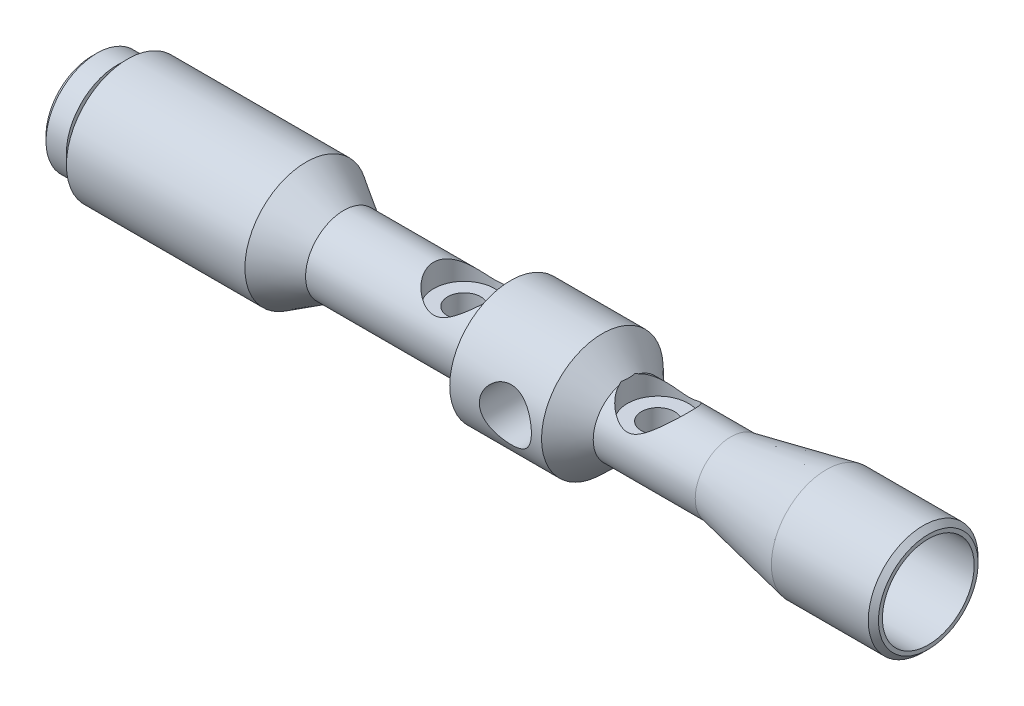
ISO-10303-21;
HEADER;
FILE_DESCRIPTION(('STEP AP214'),'2;1');
FILE_NAME('part.step','',(''),(''),'','','');
FILE_SCHEMA(('AUTOMOTIVE_DESIGN { 1 0 10303 214 1 1 1 1 }'));
ENDSEC;
DATA;
#1=APPLICATION_CONTEXT('core data for automotive mechanical design processes');
#2=APPLICATION_PROTOCOL_DEFINITION('international standard','automotive_design',2000,#1);
#3=PRODUCT_CONTEXT('',#1,'mechanical');
#4=PRODUCT('Part','Part','',(#3));
#5=PRODUCT_RELATED_PRODUCT_CATEGORY('part','',(#4));
#6=PRODUCT_DEFINITION_FORMATION('','',#4);
#7=PRODUCT_DEFINITION_CONTEXT('part definition',#1,'design');
#8=PRODUCT_DEFINITION('design','',#6,#7);
#9=PRODUCT_DEFINITION_SHAPE('','',#8);
#10=(LENGTH_UNIT() NAMED_UNIT(*) SI_UNIT(.MILLI.,.METRE.));
#11=(NAMED_UNIT(*) PLANE_ANGLE_UNIT() SI_UNIT($,.RADIAN.));
#12=(NAMED_UNIT(*) SI_UNIT($,.STERADIAN.) SOLID_ANGLE_UNIT());
#13=UNCERTAINTY_MEASURE_WITH_UNIT(LENGTH_MEASURE(1.E-05),#10,'distance_accuracy_value','');
#14=(GEOMETRIC_REPRESENTATION_CONTEXT(3) GLOBAL_UNCERTAINTY_ASSIGNED_CONTEXT((#13)) GLOBAL_UNIT_ASSIGNED_CONTEXT((#10,
#11,#12)) REPRESENTATION_CONTEXT('',''));
#15=CARTESIAN_POINT('',(0.,0.,0.));
#16=DIRECTION('',(0.,0.,1.));
#17=DIRECTION('',(1.,0.,0.));
#18=AXIS2_PLACEMENT_3D('',#15,#16,#17);
#19=CARTESIAN_POINT('',(-61.4329368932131,0.,0.));
#20=DIRECTION('',(1.,0.,0.));
#21=DIRECTION('',(0.,0.,-1.));
#22=AXIS2_PLACEMENT_3D('',#19,#20,#21);
#23=PLANE('',#22);
#24=CARTESIAN_POINT('',(-61.4329368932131,0.,0.));
#25=DIRECTION('',(1.,0.,0.));
#26=DIRECTION('',(0.,0.,-1.));
#27=AXIS2_PLACEMENT_3D('',#24,#25,#26);
#28=CIRCLE('',#27,9.00000000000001);
#29=CARTESIAN_POINT('',(-61.4329368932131,0.,-9.00000000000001));
#30=VERTEX_POINT('',#29);
#31=EDGE_CURVE('E48',#30,#30,#28,.F.);
#32=ORIENTED_EDGE('',*,*,#31,.T.);
#33=EDGE_LOOP('',(#32));
#34=FACE_BOUND('',#33,.T.);
#35=CARTESIAN_POINT('',(-61.4329368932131,0.,0.));
#36=DIRECTION('',(-1.,0.,0.));
#37=DIRECTION('',(0.,0.,1.));
#38=AXIS2_PLACEMENT_3D('',#35,#36,#37);
#39=CIRCLE('',#38,7.);
#40=CARTESIAN_POINT('',(-61.4329368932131,0.,7.));
#41=VERTEX_POINT('',#40);
#42=EDGE_CURVE('E284',#41,#41,#39,.T.);
#43=ORIENTED_EDGE('',*,*,#42,.F.);
#44=EDGE_LOOP('',(#43));
#45=FACE_BOUND('',#44,.T.);
#46=ADVANCED_FACE('F40',(#34,#45),#23,.F.);
#47=CARTESIAN_POINT('',(-47.3415678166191,0.,0.));
#48=DIRECTION('',(-1.,0.,0.));
#49=DIRECTION('',(0.,0.,1.));
#50=AXIS2_PLACEMENT_3D('',#47,#48,#49);
#51=CYLINDRICAL_SURFACE('',#50,10.);
#52=CARTESIAN_POINT('',(-60.4329368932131,0.,0.));
#53=DIRECTION('',(1.,0.,0.));
#54=DIRECTION('',(0.,0.,-1.));
#55=AXIS2_PLACEMENT_3D('',#52,#53,#54);
#56=CIRCLE('',#55,10.);
#57=CARTESIAN_POINT('',(-60.4329368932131,0.,-10.));
#58=VERTEX_POINT('',#57);
#59=EDGE_CURVE('E11',#58,#58,#56,.T.);
#60=ORIENTED_EDGE('',*,*,#59,.T.);
#61=EDGE_LOOP('',(#60));
#62=FACE_BOUND('',#61,.T.);
#63=CARTESIAN_POINT('',(-56.4329368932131,0.,0.));
#64=DIRECTION('',(-1.,0.,0.));
#65=DIRECTION('',(0.,0.,1.));
#66=AXIS2_PLACEMENT_3D('',#63,#64,#65);
#67=CIRCLE('',#66,10.);
#68=CARTESIAN_POINT('',(-56.4329368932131,0.,10.));
#69=VERTEX_POINT('',#68);
#70=EDGE_CURVE('E238',#69,#69,#67,.T.);
#71=ORIENTED_EDGE('',*,*,#70,.T.);
#72=EDGE_LOOP('',(#71));
#73=FACE_BOUND('',#72,.T.);
#74=ADVANCED_FACE('F211',(#62,#73),#51,.T.);
#75=CARTESIAN_POINT('',(-56.4329368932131,0.,-10.));
#76=DIRECTION('',(-1.,0.,0.));
#77=DIRECTION('',(0.,0.,1.));
#78=AXIS2_PLACEMENT_3D('',#75,#76,#77);
#79=PLANE('',#78);
#80=ORIENTED_EDGE('',*,*,#70,.F.);
#81=EDGE_LOOP('',(#80));
#82=FACE_BOUND('',#81,.T.);
#83=CARTESIAN_POINT('',(-56.4329368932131,0.,0.));
#84=DIRECTION('',(-1.,0.,0.));
#85=DIRECTION('',(0.,0.,1.));
#86=AXIS2_PLACEMENT_3D('',#83,#84,#85);
#87=CIRCLE('',#86,8.49999999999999);
#88=CARTESIAN_POINT('',(-56.4329368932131,0.,8.49999999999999));
#89=VERTEX_POINT('',#88);
#90=EDGE_CURVE('E240',#89,#89,#87,.T.);
#91=ORIENTED_EDGE('',*,*,#90,.T.);
#92=EDGE_LOOP('',(#91));
#93=FACE_BOUND('',#92,.T.);
#94=ADVANCED_FACE('F207',(#82,#93),#79,.F.);
#95=CARTESIAN_POINT('',(-47.3415678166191,0.,0.));
#96=DIRECTION('',(-1.,0.,0.));
#97=DIRECTION('',(0.,0.,1.));
#98=AXIS2_PLACEMENT_3D('',#95,#96,#97);
#99=CYLINDRICAL_SURFACE('',#98,8.49999999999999);
#100=ORIENTED_EDGE('',*,*,#90,.F.);
#101=EDGE_LOOP('',(#100));
#102=FACE_BOUND('',#101,.T.);
#103=CARTESIAN_POINT('',(-54.4329368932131,0.,0.));
#104=DIRECTION('',(-1.,0.,0.));
#105=DIRECTION('',(0.,0.,1.));
#106=AXIS2_PLACEMENT_3D('',#103,#104,#105);
#107=CIRCLE('',#106,8.49999999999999);
#108=CARTESIAN_POINT('',(-54.4329368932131,0.,8.49999999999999));
#109=VERTEX_POINT('',#108);
#110=EDGE_CURVE('E245',#109,#109,#107,.T.);
#111=ORIENTED_EDGE('',*,*,#110,.T.);
#112=EDGE_LOOP('',(#111));
#113=FACE_BOUND('',#112,.T.);
#114=ADVANCED_FACE('F203',(#102,#113),#99,.T.);
#115=CARTESIAN_POINT('',(-54.4329368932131,0.,-8.49999999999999));
#116=DIRECTION('',(1.,0.,0.));
#117=DIRECTION('',(0.,0.,-1.));
#118=AXIS2_PLACEMENT_3D('',#115,#116,#117);
#119=PLANE('',#118);
#120=ORIENTED_EDGE('',*,*,#110,.F.);
#121=EDGE_LOOP('',(#120));
#122=FACE_BOUND('',#121,.T.);
#123=CARTESIAN_POINT('',(-54.4329368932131,0.,0.));
#124=DIRECTION('',(-1.,0.,0.));
#125=DIRECTION('',(0.,0.,1.));
#126=AXIS2_PLACEMENT_3D('',#123,#124,#125);
#127=CIRCLE('',#126,12.);
#128=CARTESIAN_POINT('',(-54.4329368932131,0.,12.));
#129=VERTEX_POINT('',#128);
#130=EDGE_CURVE('E248',#129,#129,#127,.T.);
#131=ORIENTED_EDGE('',*,*,#130,.T.);
#132=EDGE_LOOP('',(#131));
#133=FACE_BOUND('',#132,.T.);
#134=ADVANCED_FACE('F199',(#122,#133),#119,.F.);
#135=CARTESIAN_POINT('',(-47.3415678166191,0.,0.));
#136=DIRECTION('',(-1.,0.,0.));
#137=DIRECTION('',(0.,0.,1.));
#138=AXIS2_PLACEMENT_3D('',#135,#136,#137);
#139=CYLINDRICAL_SURFACE('',#138,12.);
#140=ORIENTED_EDGE('',*,*,#130,.F.);
#141=EDGE_LOOP('',(#140));
#142=FACE_BOUND('',#141,.T.);
#143=CARTESIAN_POINT('',(-19.4329368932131,0.,0.));
#144=DIRECTION('',(-1.,0.,0.));
#145=DIRECTION('',(0.,0.,1.));
#146=AXIS2_PLACEMENT_3D('',#143,#144,#145);
#147=CIRCLE('',#146,12.);
#148=CARTESIAN_POINT('',(-19.4329368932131,0.,12.));
#149=VERTEX_POINT('',#148);
#150=EDGE_CURVE('E251',#149,#149,#147,.T.);
#151=ORIENTED_EDGE('',*,*,#150,.T.);
#152=EDGE_LOOP('',(#151));
#153=FACE_BOUND('',#152,.T.);
#154=ADVANCED_FACE('F195',(#142,#153),#139,.T.);
#155=CARTESIAN_POINT('',(-12.0371496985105,0.,0.));
#156=DIRECTION('',(-1.,0.,0.));
#157=DIRECTION('',(0.,0.,1.));
#158=AXIS2_PLACEMENT_3D('',#155,#156,#157);
#159=CONICAL_SURFACE('',#158,7.49999999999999,0.546612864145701);
#160=ORIENTED_EDGE('',*,*,#150,.F.);
#161=EDGE_LOOP('',(#160));
#162=FACE_BOUND('',#161,.T.);
#163=CARTESIAN_POINT('',(-12.0371496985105,0.,0.));
#164=DIRECTION('',(-1.,0.,0.));
#165=DIRECTION('',(0.,0.,1.));
#166=AXIS2_PLACEMENT_3D('',#163,#164,#165);
#167=CIRCLE('',#166,7.49999999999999);
#168=CARTESIAN_POINT('',(-12.0371496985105,0.,7.49999999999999));
#169=VERTEX_POINT('',#168);
#170=EDGE_CURVE('E254',#169,#169,#167,.T.);
#171=ORIENTED_EDGE('',*,*,#170,.T.);
#172=EDGE_LOOP('',(#171));
#173=FACE_BOUND('',#172,.T.);
#174=ADVANCED_FACE('F190',(#162,#173),#159,.T.);
#175=CARTESIAN_POINT('',(-47.3415678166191,0.,0.));
#176=DIRECTION('',(-1.,0.,0.));
#177=DIRECTION('',(0.,0.,1.));
#178=AXIS2_PLACEMENT_3D('',#175,#176,#177);
#179=CYLINDRICAL_SURFACE('',#178,7.49999999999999);
#180=CARTESIAN_POINT('',(11.5703527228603,-6.75925291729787,3.25000000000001));
#181=CARTESIAN_POINT('',(11.6566974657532,-6.75925395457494,3.24999893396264));
#182=CARTESIAN_POINT('',(11.7430726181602,-6.76091501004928,3.24655172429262));
#183=CARTESIAN_POINT('',(11.9151667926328,-6.76749366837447,3.23281233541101));
#184=CARTESIAN_POINT('',(12.0008853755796,-6.7724132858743,3.22251592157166));
#185=CARTESIAN_POINT('',(12.2564093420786,-6.79186654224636,3.18143757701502));
#186=CARTESIAN_POINT('',(12.4243493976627,-6.81109394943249,3.1404669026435));
#187=CARTESIAN_POINT('',(12.7494883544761,-6.85944472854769,3.03337897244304));
#188=CARTESIAN_POINT('',(12.9067300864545,-6.8885254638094,2.96736991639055));
#189=CARTESIAN_POINT('',(13.2079042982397,-6.95323213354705,2.81240055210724));
#190=CARTESIAN_POINT('',(13.3518391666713,-6.98885688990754,2.7234443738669));
#191=CARTESIAN_POINT('',(13.6320513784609,-7.06532411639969,2.51869594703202));
#192=CARTESIAN_POINT('',(13.7673214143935,-7.10635246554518,2.40159478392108));
#193=CARTESIAN_POINT('',(14.0170575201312,-7.18748199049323,2.14662426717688));
#194=CARTESIAN_POINT('',(14.1315151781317,-7.22758278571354,2.00874655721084));
#195=CARTESIAN_POINT('',(14.3416588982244,-7.3046296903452,1.70808662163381));
#196=CARTESIAN_POINT('',(14.4361924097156,-7.34133485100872,1.54443146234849));
#197=CARTESIAN_POINT('',(14.5959457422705,-7.40515555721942,1.20166043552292));
#198=CARTESIAN_POINT('',(14.6611795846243,-7.43227568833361,1.02255201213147));
#199=CARTESIAN_POINT('',(14.7567712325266,-7.4725491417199,0.664547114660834));
#200=CARTESIAN_POINT('',(14.7888703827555,-7.48639672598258,0.486195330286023));
#201=CARTESIAN_POINT('',(14.822928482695,-7.50109973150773,0.126136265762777));
#202=CARTESIAN_POINT('',(14.8249007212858,-7.5019608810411,-0.0555694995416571));
#203=CARTESIAN_POINT('',(14.7995173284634,-7.49098830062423,-0.404439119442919));
#204=CARTESIAN_POINT('',(14.7740807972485,-7.47998524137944,-0.571773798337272));
#205=CARTESIAN_POINT('',(14.6979183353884,-7.44768302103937,-0.899525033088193));
#206=CARTESIAN_POINT('',(14.6471905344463,-7.42638309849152,-1.05994107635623));
#207=CARTESIAN_POINT('',(14.5213129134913,-7.37511507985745,-1.37227153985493));
#208=CARTESIAN_POINT('',(14.4458013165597,-7.3450193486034,-1.52401833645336));
#209=CARTESIAN_POINT('',(14.2728727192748,-7.27906125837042,-1.81308616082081));
#210=CARTESIAN_POINT('',(14.175447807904,-7.24319681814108,-1.9504019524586));
#211=CARTESIAN_POINT('',(13.9529398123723,-7.16606815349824,-2.2177133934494));
#212=CARTESIAN_POINT('',(13.8263258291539,-7.12460068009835,-2.34637784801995));
#213=CARTESIAN_POINT('',(13.5533020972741,-7.0429137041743,-2.58125203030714));
#214=CARTESIAN_POINT('',(13.4068834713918,-7.00269477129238,-2.68745163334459));
#215=CARTESIAN_POINT('',(13.0914308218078,-6.92653737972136,-2.87820271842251));
#216=CARTESIAN_POINT('',(12.9217491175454,-6.89081947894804,-2.96177893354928));
#217=CARTESIAN_POINT('',(12.5687652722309,-6.83039044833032,-3.09861693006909));
#218=CARTESIAN_POINT('',(12.3854739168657,-6.80567070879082,-3.15190243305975));
#219=CARTESIAN_POINT('',(12.0238452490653,-6.77222366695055,-3.22311049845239));
#220=CARTESIAN_POINT('',(11.846028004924,-6.76251726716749,-3.24320451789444));
#221=CARTESIAN_POINT('',(11.4893354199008,-6.75738996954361,-3.2538800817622));
#222=CARTESIAN_POINT('',(11.310460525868,-6.76196341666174,-3.24447330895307));
#223=CARTESIAN_POINT('',(10.9702778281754,-6.78386244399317,-3.19839976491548));
#224=CARTESIAN_POINT('',(10.8086302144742,-6.80024989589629,-3.16373651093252));
#225=CARTESIAN_POINT('',(10.4936072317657,-6.84269570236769,-3.07084731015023));
#226=CARTESIAN_POINT('',(10.340233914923,-6.86875644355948,-3.01261554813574));
#227=CARTESIAN_POINT('',(10.0385714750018,-6.92899874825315,-2.87142729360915));
#228=CARTESIAN_POINT('',(9.89080093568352,-6.96348653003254,-2.7874978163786));
#229=CARTESIAN_POINT('',(9.61069514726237,-7.0362936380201,-2.5982384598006));
#230=CARTESIAN_POINT('',(9.47836698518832,-7.07461470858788,-2.4928988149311));
#231=CARTESIAN_POINT('',(9.22057400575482,-7.15490246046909,-2.25272585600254));
#232=CARTESIAN_POINT('',(9.09678065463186,-7.19688875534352,-2.11609762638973));
#233=CARTESIAN_POINT('',(8.8735355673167,-7.27663620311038,-1.82307427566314));
#234=CARTESIAN_POINT('',(8.77408655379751,-7.31439688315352,-1.66667694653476));
#235=CARTESIAN_POINT('',(8.60214290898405,-7.38183334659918,-1.33679064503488));
#236=CARTESIAN_POINT('',(8.5298119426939,-7.41145975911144,-1.1632056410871));
#237=CARTESIAN_POINT('',(8.41595003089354,-7.45889076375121,-0.804705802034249));
#238=CARTESIAN_POINT('',(8.37439909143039,-7.47670302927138,-0.619798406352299));
#239=CARTESIAN_POINT('',(8.32594135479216,-7.49755141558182,-0.258776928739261));
#240=CARTESIAN_POINT('',(8.31668361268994,-7.50158974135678,-0.0830344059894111));
#241=CARTESIAN_POINT('',(8.3266389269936,-7.49727637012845,0.267466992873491));
#242=CARTESIAN_POINT('',(8.34584623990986,-7.48892717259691,0.442226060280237));
#243=CARTESIAN_POINT('',(8.41050128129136,-7.46132442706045,0.778438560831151));
#244=CARTESIAN_POINT('',(8.45485021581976,-7.44252809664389,0.940144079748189));
#245=CARTESIAN_POINT('',(8.56728114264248,-7.39616958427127,1.2537226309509));
#246=CARTESIAN_POINT('',(8.63536744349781,-7.3686058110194,1.40559387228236));
#247=CARTESIAN_POINT('',(8.7967886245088,-7.30577749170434,1.70286588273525));
#248=CARTESIAN_POINT('',(8.89113579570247,-7.27021841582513,1.84765309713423));
#249=CARTESIAN_POINT('',(9.10098384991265,-7.195532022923,2.1199739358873));
#250=CARTESIAN_POINT('',(9.21649329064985,-7.15640326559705,2.24750054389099));
#251=CARTESIAN_POINT('',(9.47546594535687,-7.07529598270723,2.49157346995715));
#252=CARTESIAN_POINT('',(9.62037032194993,-7.03332224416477,2.60659475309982));
#253=CARTESIAN_POINT('',(9.92873987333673,-6.95415631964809,2.81101020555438));
#254=CARTESIAN_POINT('',(10.0922159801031,-6.91696697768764,2.90038917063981));
#255=CARTESIAN_POINT('',(10.3481099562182,-6.86835612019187,3.01286307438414));
#256=CARTESIAN_POINT('',(10.4352371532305,-6.85334194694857,3.0467675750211));
#257=CARTESIAN_POINT('',(10.6124833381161,-6.82622624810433,3.10704538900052));
#258=CARTESIAN_POINT('',(10.7026008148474,-6.81412327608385,3.13342244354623));
#259=CARTESIAN_POINT('',(10.8849018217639,-6.79331729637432,3.17827788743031));
#260=CARTESIAN_POINT('',(10.9770792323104,-6.78460534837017,3.19677705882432));
#261=CARTESIAN_POINT('',(11.1629150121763,-6.77088884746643,3.22572845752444));
#262=CARTESIAN_POINT('',(11.2565721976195,-6.76588147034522,3.23618681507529));
#263=CARTESIAN_POINT('',(11.3871047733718,-6.7616372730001,3.24503715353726));
#264=CARTESIAN_POINT('',(11.4237218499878,-6.76074392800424,3.24689751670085));
#265=CARTESIAN_POINT('',(11.4970083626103,-6.75955152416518,3.24937917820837));
#266=CARTESIAN_POINT('',(11.5336777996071,-6.75925247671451,3.2500004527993));
#267=CARTESIAN_POINT('',(11.5703527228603,-6.75925291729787,3.25000000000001));
#268=B_SPLINE_CURVE_WITH_KNOTS('',3,(#180,#181,#182,#183,#184,#185,#186,#187,#188,#189,#190,
#191,#192,#193,#194,#195,#196,#197,#198,#199,#200,#201,#202,#203,#204,#205,#206,#207,#208,#209,
#210,#211,#212,#213,#214,#215,#216,#217,#218,#219,#220,#221,#222,#223,#224,#225,#226,#227,#228,
#229,#230,#231,#232,#233,#234,#235,#236,#237,#238,#239,#240,#241,#242,#243,#244,#245,#246,#247,
#248,#249,#250,#251,#252,#253,#254,#255,#256,#257,#258,#259,#260,#261,#262,#263,#264,#265,#266,
#267),.UNSPECIFIED.,.T.,.F.,(4,2,2,2,2,2,2,2,2,2,2,2,2,2,2,2,2,2,2,2,2,2,2,2,2,2,2,2,2,2,2,2,2,
2,2,2,2,2,2,2,2,2,2,4),(0.,0.258993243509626,0.51814676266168,1.03714488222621,1.55392531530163,
2.07061280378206,2.61891272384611,3.16743376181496,3.74205865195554,4.31640826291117,
4.85874294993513,5.40083840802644,5.907303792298,6.41380663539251,6.92805885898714,
7.44249703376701,7.99569803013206,8.54914781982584,9.12361540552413,9.69763248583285,
10.2323473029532,10.766850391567,11.2630180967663,11.7593082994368,12.2773804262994,
12.7956893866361,13.3603397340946,13.9250532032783,14.4931220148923,15.0608214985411,
15.5862159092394,16.1115043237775,16.6154325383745,17.1194522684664,17.6465223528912,
18.1738060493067,18.7403582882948,19.3072457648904,19.5909917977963,19.8745965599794,
20.1574484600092,20.4400845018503,20.5500897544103,20.6600971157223),.UNSPECIFIED.);
#269=CARTESIAN_POINT('',(11.5703527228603,-6.75925291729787,3.25000000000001));
#270=VERTEX_POINT('',#269);
#271=EDGE_CURVE('E90',#270,#270,#268,.T.);
#272=ORIENTED_EDGE('',*,*,#271,.T.);
#273=EDGE_LOOP('',(#272));
#274=FACE_BOUND('',#273,.T.);
#275=CARTESIAN_POINT('',(11.5703527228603,4.49999999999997,6.00000000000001));
#276=CARTESIAN_POINT('',(11.4576841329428,4.500002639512,5.99999888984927));
#277=CARTESIAN_POINT('',(11.3449742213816,4.50425266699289,5.99681772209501));
#278=CARTESIAN_POINT('',(11.1204860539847,4.52104267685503,5.98416904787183));
#279=CARTESIAN_POINT('',(11.008708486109,4.53358831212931,5.97469725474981));
#280=CARTESIAN_POINT('',(10.7866970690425,4.56640244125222,5.94965464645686));
#281=CARTESIAN_POINT('',(10.6764678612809,4.58669046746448,5.93406840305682));
#282=CARTESIAN_POINT('',(10.458451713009,4.63411085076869,5.89711171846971));
#283=CARTESIAN_POINT('',(10.3506664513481,4.66124776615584,5.87573742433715));
#284=CARTESIAN_POINT('',(9.95770822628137,4.77231947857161,5.78667872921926));
#285=CARTESIAN_POINT('',(9.68133499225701,4.87459868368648,5.70188006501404));
#286=CARTESIAN_POINT('',(9.28484093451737,5.04571697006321,5.5494746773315));
#287=CARTESIAN_POINT('',(9.15547923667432,5.10582566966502,5.49435438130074));
#288=CARTESIAN_POINT('',(8.90250743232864,5.23022919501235,5.37606280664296));
#289=CARTESIAN_POINT('',(8.77889717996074,5.2945239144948,5.31289173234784));
#290=CARTESIAN_POINT('',(8.49372387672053,5.44945317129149,5.15458662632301));
#291=CARTESIAN_POINT('',(8.334601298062,5.54120473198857,5.05615512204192));
#292=CARTESIAN_POINT('',(8.02680391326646,5.7263997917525,4.84541487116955));
#293=CARTESIAN_POINT('',(7.87813288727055,5.81984388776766,4.73310114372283));
#294=CARTESIAN_POINT('',(7.59161928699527,6.00570151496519,4.49492551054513));
#295=CARTESIAN_POINT('',(7.45376811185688,6.0981158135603,4.36907455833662));
#296=CARTESIAN_POINT('',(7.1893627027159,6.27963739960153,4.1038957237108));
#297=CARTESIAN_POINT('',(7.0628047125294,6.36874578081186,3.96457235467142));
#298=CARTESIAN_POINT('',(6.84568241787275,6.52441419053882,3.70142676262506));
#299=CARTESIAN_POINT('',(6.75294416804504,6.5919533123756,3.57997261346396));
#300=CARTESIAN_POINT('',(6.57598808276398,6.7223582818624,3.3286529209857));
#301=CARTESIAN_POINT('',(6.49176838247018,6.78522515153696,3.19878922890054));
#302=CARTESIAN_POINT('',(6.33270463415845,6.90508717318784,2.93108422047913));
#303=CARTESIAN_POINT('',(6.25784968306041,6.96208913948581,2.79325245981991));
#304=CARTESIAN_POINT('',(6.1182871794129,7.06915944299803,2.5099600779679));
#305=CARTESIAN_POINT('',(6.05357794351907,7.11922893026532,2.36450072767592));
#306=CARTESIAN_POINT('',(5.94480930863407,7.20387191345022,2.09076745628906));
#307=CARTESIAN_POINT('',(5.89910276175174,7.23964198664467,1.96351637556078));
#308=CARTESIAN_POINT('',(5.81602896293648,7.30490114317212,1.70476185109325));
#309=CARTESIAN_POINT('',(5.77866012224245,7.33439142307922,1.57325922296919));
#310=CARTESIAN_POINT('',(5.71277656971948,7.38652779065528,1.30676465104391));
#311=CARTESIAN_POINT('',(5.68425887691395,7.40917618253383,1.1717738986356));
#312=CARTESIAN_POINT('',(5.63649247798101,7.44717985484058,0.899140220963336));
#313=CARTESIAN_POINT('',(5.61724388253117,7.46253504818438,0.761497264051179));
#314=CARTESIAN_POINT('',(5.5882811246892,7.48565989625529,0.484082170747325));
#315=CARTESIAN_POINT('',(5.57860067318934,7.49340273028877,0.344304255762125));
#316=CARTESIAN_POINT('',(5.56905986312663,7.50103377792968,0.0641976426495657));
#317=CARTESIAN_POINT('',(5.56919952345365,7.50092197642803,-0.0761310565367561));
#318=CARTESIAN_POINT('',(5.57929675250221,7.49284608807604,-0.356210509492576));
#319=CARTESIAN_POINT('',(5.58925465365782,7.48488173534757,-0.495961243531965));
#320=CARTESIAN_POINT('',(5.61881616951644,7.46128061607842,-0.773775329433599));
#321=CARTESIAN_POINT('',(5.63841956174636,7.44564402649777,-0.911838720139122));
#322=CARTESIAN_POINT('',(5.68561961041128,7.40809628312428,-1.17776802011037));
#323=CARTESIAN_POINT('',(5.7127190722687,7.38657616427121,-1.305777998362));
#324=CARTESIAN_POINT('',(5.77487579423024,7.33738343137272,-1.55866153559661));
#325=CARTESIAN_POINT('',(5.80993575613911,7.30970872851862,-1.68353401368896));
#326=CARTESIAN_POINT('',(5.92641056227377,7.21815425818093,-2.05238414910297));
#327=CARTESIAN_POINT('',(6.01915385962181,7.14571711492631,-2.29077897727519));
#328=CARTESIAN_POINT('',(6.24116460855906,6.97457946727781,-2.77062350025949));
#329=CARTESIAN_POINT('',(6.37308982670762,6.87402118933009,-3.01015528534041));
#330=CARTESIAN_POINT('',(6.66395874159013,6.6568280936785,-3.46411052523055));
#331=CARTESIAN_POINT('',(6.82291756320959,6.54018428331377,-3.67851981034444));
#332=CARTESIAN_POINT('',(7.19956299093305,6.27158127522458,-4.12282372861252));
#333=CARTESIAN_POINT('',(7.42260137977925,6.11729806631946,-4.34680360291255));
#334=CARTESIAN_POINT('',(7.77992540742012,5.8829699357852,-4.65374624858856));
#335=CARTESIAN_POINT('',(7.90295573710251,5.80430044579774,-4.75130155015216));
#336=CARTESIAN_POINT('',(8.15652890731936,5.6474980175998,-4.93664518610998));
#337=CARTESIAN_POINT('',(8.28707084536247,5.56936501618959,-5.02443469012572));
#338=CARTESIAN_POINT('',(8.54268395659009,5.42281328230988,-5.18204035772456));
#339=CARTESIAN_POINT('',(8.66707048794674,5.35418388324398,-5.25277326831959));
#340=CARTESIAN_POINT('',(8.92205711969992,5.22031452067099,-5.38583488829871));
#341=CARTESIAN_POINT('',(9.05265792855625,5.15507494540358,-5.44816263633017));
#342=CARTESIAN_POINT('',(9.31994268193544,5.02995444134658,-5.56388424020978));
#343=CARTESIAN_POINT('',(9.45661495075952,4.9700638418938,-5.61729437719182));
#344=CARTESIAN_POINT('',(9.73619725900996,4.85774674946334,-5.71470187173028));
#345=CARTESIAN_POINT('',(9.87910605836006,4.8053187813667,-5.75870109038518));
#346=CARTESIAN_POINT('',(10.2286913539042,4.69182229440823,-5.85185112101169));
#347=CARTESIAN_POINT('',(10.4383228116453,4.63547801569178,-5.89621051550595));
#348=CARTESIAN_POINT('',(10.7591451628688,4.57132783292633,-5.94589598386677));
#349=CARTESIAN_POINT('',(10.8670879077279,4.55334307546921,-5.9596459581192));
#350=CARTESIAN_POINT('',(11.0845278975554,4.52486898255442,-5.98129478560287));
#351=CARTESIAN_POINT('',(11.1940244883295,4.51437658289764,-5.98919603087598));
#352=CARTESIAN_POINT('',(11.4144315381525,4.50134795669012,-5.99899445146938));
#353=CARTESIAN_POINT('',(11.5253465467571,4.49886058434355,-6.00085475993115));
#354=CARTESIAN_POINT('',(11.7469858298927,4.50210190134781,-5.99842331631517));
#355=CARTESIAN_POINT('',(11.8577101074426,4.50783045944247,-5.99413166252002));
#356=CARTESIAN_POINT('',(12.0781593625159,4.52722824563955,-5.97949411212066));
#357=CARTESIAN_POINT('',(12.1878832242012,4.54090544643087,-5.96914213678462));
#358=CARTESIAN_POINT('',(12.4054919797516,4.57557684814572,-5.94260629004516));
#359=CARTESIAN_POINT('',(12.5133758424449,4.59657501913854,-5.92641925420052));
#360=CARTESIAN_POINT('',(12.7537434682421,4.65117837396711,-5.88370850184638));
#361=CARTESIAN_POINT('',(12.8855267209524,4.68663028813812,-5.85560438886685));
#362=CARTESIAN_POINT('',(13.1446199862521,4.76582287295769,-5.79133208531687));
#363=CARTESIAN_POINT('',(13.2719262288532,4.8095703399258,-5.75515727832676));
#364=CARTESIAN_POINT('',(13.5219930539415,4.90361509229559,-5.67524204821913));
#365=CARTESIAN_POINT('',(13.6447421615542,4.95392763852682,-5.63148391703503));
#366=CARTESIAN_POINT('',(13.8852836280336,5.05937017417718,-5.53694779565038));
#367=CARTESIAN_POINT('',(14.0030774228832,5.11449875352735,-5.4861718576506));
#368=CARTESIAN_POINT('',(14.2866972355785,5.25424136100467,-5.35313185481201));
#369=CARTESIAN_POINT('',(14.4498089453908,5.34079427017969,-5.267098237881));
#370=CARTESIAN_POINT('',(14.7659905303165,5.51769399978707,-5.08148777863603));
#371=CARTESIAN_POINT('',(14.9190562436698,5.60804236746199,-4.98190537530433));
#372=CARTESIAN_POINT('',(15.2152837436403,5.78980497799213,-4.76945739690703));
#373=CARTESIAN_POINT('',(15.3584356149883,5.88122018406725,-4.65657881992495));
#374=CARTESIAN_POINT('',(15.6343744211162,6.06262955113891,-4.41780564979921));
#375=CARTESIAN_POINT('',(15.7671629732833,6.15262393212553,-4.29191309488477));
#376=CARTESIAN_POINT('',(16.0236287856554,6.3303241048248,-4.02529879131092));
#377=CARTESIAN_POINT('',(16.1471480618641,6.41797856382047,-3.88439026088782));
#378=CARTESIAN_POINT('',(16.3819674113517,6.58749116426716,-3.58941446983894));
#379=CARTESIAN_POINT('',(16.4932655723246,6.66934839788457,-3.43534515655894));
#380=CARTESIAN_POINT('',(16.7020086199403,6.82488565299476,-3.11489511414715));
#381=CARTESIAN_POINT('',(16.7994907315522,6.8985875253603,-2.94854937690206));
#382=CARTESIAN_POINT('',(16.9793329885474,7.0358862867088,-2.60396713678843));
#383=CARTESIAN_POINT('',(17.0617016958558,7.09948889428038,-2.42573744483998));
#384=CARTESIAN_POINT('',(17.1857264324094,7.19593196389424,-2.11791382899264));
#385=CARTESIAN_POINT('',(17.23194550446,7.232078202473,-1.99117152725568));
#386=CARTESIAN_POINT('',(17.3161063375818,7.29815069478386,-1.73340203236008));
#387=CARTESIAN_POINT('',(17.3540502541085,7.3280785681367,-1.60237596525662));
#388=CARTESIAN_POINT('',(17.4211372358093,7.38114209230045,-1.33681228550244));
#389=CARTESIAN_POINT('',(17.4502849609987,7.40428133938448,-1.20227657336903));
#390=CARTESIAN_POINT('',(17.4993713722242,7.44332187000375,-0.930486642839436));
#391=CARTESIAN_POINT('',(17.5193097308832,7.45922289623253,-0.793232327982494));
#392=CARTESIAN_POINT('',(17.5497071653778,7.48348817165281,-0.516495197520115));
#393=CARTESIAN_POINT('',(17.5601309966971,7.49182439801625,-0.377006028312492));
#394=CARTESIAN_POINT('',(17.5711935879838,7.50067196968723,-0.0973911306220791));
#395=CARTESIAN_POINT('',(17.5718323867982,7.50118334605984,0.0427345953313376));
#396=CARTESIAN_POINT('',(17.5633134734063,7.49436935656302,0.32250388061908));
#397=CARTESIAN_POINT('',(17.5541551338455,7.48704348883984,0.462147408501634));
#398=CARTESIAN_POINT('',(17.5261997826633,7.46471993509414,0.739838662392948));
#399=CARTESIAN_POINT('',(17.5074029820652,7.44972241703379,0.877886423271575));
#400=CARTESIAN_POINT('',(17.4617426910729,7.41338619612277,1.1440081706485));
#401=CARTESIAN_POINT('',(17.4353677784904,7.39243220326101,1.27221908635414));
#402=CARTESIAN_POINT('',(17.3746301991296,7.3443377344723,1.5255678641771));
#403=CARTESIAN_POINT('',(17.3402648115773,7.31719515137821,1.65070466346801));
#404=CARTESIAN_POINT('',(17.2258196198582,7.22717494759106,2.02042918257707));
#405=CARTESIAN_POINT('',(17.1343584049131,7.15567877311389,2.25951521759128));
#406=CARTESIAN_POINT('',(16.9152195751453,6.98657914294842,2.74019243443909));
#407=CARTESIAN_POINT('',(16.7849638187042,6.88716537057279,2.97994641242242));
#408=CARTESIAN_POINT('',(16.4974330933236,6.67210842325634,3.43457572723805));
#409=CARTESIAN_POINT('',(16.3401437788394,6.55645663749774,3.64943775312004));
#410=CARTESIAN_POINT('',(15.9674399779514,6.2899824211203,4.09467435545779));
#411=CARTESIAN_POINT('',(15.7467179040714,6.13680638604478,4.31922252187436));
#412=CARTESIAN_POINT('',(15.3929972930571,5.90379709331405,4.62729689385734));
#413=CARTESIAN_POINT('',(15.2711900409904,5.82550996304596,4.72527701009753));
#414=CARTESIAN_POINT('',(15.0201210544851,5.66932196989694,4.91157096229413));
#415=CARTESIAN_POINT('',(14.8908601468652,5.59142106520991,4.99988586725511));
#416=CARTESIAN_POINT('',(14.6356854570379,5.44392561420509,5.15989789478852));
#417=CARTESIAN_POINT('',(14.5103450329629,5.37416847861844,5.23236114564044));
#418=CARTESIAN_POINT('',(14.2533015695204,5.23796925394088,5.3687016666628));
#419=CARTESIAN_POINT('',(14.1215976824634,5.17152760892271,5.43257778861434));
#420=CARTESIAN_POINT('',(13.8518921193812,5.04394127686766,5.55123737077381));
#421=CARTESIAN_POINT('',(13.7138994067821,4.98278938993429,5.60603328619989));
#422=CARTESIAN_POINT('',(13.4315513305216,4.86799661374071,5.70599637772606));
#423=CARTESIAN_POINT('',(13.2871992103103,4.81435195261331,5.75116839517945));
#424=CARTESIAN_POINT('',(12.9319528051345,4.69741665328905,5.84740665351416));
#425=CARTESIAN_POINT('',(12.7178880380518,4.63908655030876,5.89338890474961));
#426=CARTESIAN_POINT('',(12.3902305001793,4.57282553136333,5.94474819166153));
#427=CARTESIAN_POINT('',(12.2800603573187,4.55428756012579,5.95892547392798));
#428=CARTESIAN_POINT('',(12.0580975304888,4.52502366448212,5.9811795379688));
#429=CARTESIAN_POINT('',(11.9463060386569,4.51429227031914,5.98926059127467));
#430=CARTESIAN_POINT('',(11.7902798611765,4.50515686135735,5.99612943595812));
#431=CARTESIAN_POINT('',(11.7463345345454,4.50322522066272,5.99757995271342));
#432=CARTESIAN_POINT('',(11.6583791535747,4.50064619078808,5.99951551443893));
#433=CARTESIAN_POINT('',(11.6143690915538,4.49999896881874,6.00000043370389));
#434=CARTESIAN_POINT('',(11.5703527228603,4.49999999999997,6.00000000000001));
#435=B_SPLINE_CURVE_WITH_KNOTS('',3,(#275,#276,#277,#278,#279,#280,#281,#282,#283,#284,#285,
#286,#287,#288,#289,#290,#291,#292,#293,#294,#295,#296,#297,#298,#299,#300,#301,#302,#303,#304,
#305,#306,#307,#308,#309,#310,#311,#312,#313,#314,#315,#316,#317,#318,#319,#320,#321,#322,#323,
#324,#325,#326,#327,#328,#329,#330,#331,#332,#333,#334,#335,#336,#337,#338,#339,#340,#341,#342,
#343,#344,#345,#346,#347,#348,#349,#350,#351,#352,#353,#354,#355,#356,#357,#358,#359,#360,#361,
#362,#363,#364,#365,#366,#367,#368,#369,#370,#371,#372,#373,#374,#375,#376,#377,#378,#379,#380,
#381,#382,#383,#384,#385,#386,#387,#388,#389,#390,#391,#392,#393,#394,#395,#396,#397,#398,#399,
#400,#401,#402,#403,#404,#405,#406,#407,#408,#409,#410,#411,#412,#413,#414,#415,#416,#417,#418,
#419,#420,#421,#422,#423,#424,#425,#426,#427,#428,#429,#430,#431,#432,#433,#434),.UNSPECIFIED.,
.T.,.F.,(4,2,2,2,2,2,2,2,2,2,2,2,2,2,2,2,2,2,2,2,2,2,2,2,2,2,2,2,2,2,2,2,2,2,2,2,2,2,2,2,2,2,2,
2,2,2,2,2,2,2,2,2,2,2,2,2,2,2,2,2,2,2,2,2,2,2,2,2,2,2,2,2,2,2,2,2,2,2,2,4),(0.,
0.337954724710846,0.67613998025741,1.01518410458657,1.35445447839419,2.2684308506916,
2.72700785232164,3.18557321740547,3.80997008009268,4.43459162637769,5.0587115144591,
5.68262303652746,6.18338990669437,6.68404691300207,7.18411548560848,7.68410100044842,
8.10326541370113,8.52234988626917,8.94129306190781,9.3602412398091,9.78066026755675,
10.2010801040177,10.6215141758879,11.0419385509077,11.4393114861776,11.8368194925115,
12.6312734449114,13.5022572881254,14.3737300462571,15.4247987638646,15.9513359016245,
16.4778099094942,16.9535611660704,17.4293667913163,17.9042939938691,18.3791271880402,
19.0408979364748,19.3714232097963,19.7018132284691,20.0342158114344,20.3666130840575,
20.6993443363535,21.0322563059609,21.449602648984,21.8672924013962,22.2859709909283,
22.7045274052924,23.3148117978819,23.9253474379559,24.5364851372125,25.1475272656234,
25.7673327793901,26.38723513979,27.0054341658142,27.6232818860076,28.0418769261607,
28.4603628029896,28.8786265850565,29.2969052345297,29.7167270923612,30.1365472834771,
30.5563943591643,30.976232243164,31.3734752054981,31.7708536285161,32.5650502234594,
33.4331511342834,34.3017141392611,35.3480559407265,35.8722312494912,36.3963485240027,
36.8781198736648,37.3599555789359,37.8411247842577,38.3220513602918,38.9987187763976,
39.3362060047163,39.6734565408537,39.8054685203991,39.9374976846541),.UNSPECIFIED.);
#436=CARTESIAN_POINT('',(11.5703527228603,4.49999999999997,6.00000000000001));
#437=VERTEX_POINT('',#436);
#438=EDGE_CURVE('E166',#437,#437,#435,.T.);
#439=ORIENTED_EDGE('',*,*,#438,.T.);
#440=EDGE_LOOP('',(#439));
#441=FACE_BOUND('',#440,.T.);
#442=ORIENTED_EDGE('',*,*,#170,.F.);
#443=EDGE_LOOP('',(#442));
#444=FACE_BOUND('',#443,.T.);
#445=CARTESIAN_POINT('',(17.9670631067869,0.,0.));
#446=DIRECTION('',(-1.,0.,0.));
#447=DIRECTION('',(0.,0.,1.));
#448=AXIS2_PLACEMENT_3D('',#445,#446,#447);
#449=CIRCLE('',#448,7.49999999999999);
#450=CARTESIAN_POINT('',(17.9670631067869,0.,7.49999999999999));
#451=VERTEX_POINT('',#450);
#452=EDGE_CURVE('E257',#451,#451,#449,.T.);
#453=ORIENTED_EDGE('',*,*,#452,.T.);
#454=EDGE_LOOP('',(#453));
#455=FACE_BOUND('',#454,.T.);
#456=ADVANCED_FACE('F186',(#274,#441,#444,#455),#179,.T.);
#457=CARTESIAN_POINT('',(20.6620418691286,0.,0.));
#458=DIRECTION('',(1.,0.,0.));
#459=DIRECTION('',(0.,0.,-1.));
#460=AXIS2_PLACEMENT_3D('',#457,#458,#459);
#461=CONICAL_SURFACE('',#460,11.9292198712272,1.0241834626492);
#462=ORIENTED_EDGE('',*,*,#452,.F.);
#463=EDGE_LOOP('',(#462));
#464=FACE_BOUND('',#463,.T.);
#465=CARTESIAN_POINT('',(20.6620418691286,0.,0.));
#466=DIRECTION('',(-1.,0.,0.));
#467=DIRECTION('',(0.,0.,1.));
#468=AXIS2_PLACEMENT_3D('',#465,#466,#467);
#469=CIRCLE('',#468,11.9292198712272);
#470=CARTESIAN_POINT('',(20.6620418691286,0.,11.9292198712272));
#471=VERTEX_POINT('',#470);
#472=EDGE_CURVE('E260',#471,#471,#469,.T.);
#473=ORIENTED_EDGE('',*,*,#472,.T.);
#474=EDGE_LOOP('',(#473));
#475=FACE_BOUND('',#474,.T.);
#476=ADVANCED_FACE('F155',(#464,#475),#461,.T.);
#477=CARTESIAN_POINT('',(-47.3415678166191,0.,0.));
#478=DIRECTION('',(-1.,0.,0.));
#479=DIRECTION('',(0.,0.,1.));
#480=AXIS2_PLACEMENT_3D('',#477,#478,#479);
#481=CYLINDRICAL_SURFACE('',#480,11.9292198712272);
#482=CARTESIAN_POINT('',(36.6670631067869,0.,11.9292198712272));
#483=CARTESIAN_POINT('',(36.6670621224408,-0.13633953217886,11.929219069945));
#484=CARTESIAN_POINT('',(36.6615885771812,-0.272720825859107,11.9268762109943));
#485=CARTESIAN_POINT('',(36.6397465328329,-0.54450819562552,11.917563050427));
#486=CARTESIAN_POINT('',(36.6233713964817,-0.679913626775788,11.9105899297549));
#487=CARTESIAN_POINT('',(36.5798552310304,-0.948956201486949,11.8921815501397));
#488=CARTESIAN_POINT('',(36.5526928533,-1.08258929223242,11.8807374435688));
#489=CARTESIAN_POINT('',(36.4878737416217,-1.34690427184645,11.8536828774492));
#490=CARTESIAN_POINT('',(36.4502127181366,-1.47758493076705,11.8380707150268));
#491=CARTESIAN_POINT('',(36.3649281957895,-1.73457239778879,11.8031473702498));
#492=CARTESIAN_POINT('',(36.3173441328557,-1.86089427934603,11.7838508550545));
#493=CARTESIAN_POINT('',(36.2125491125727,-2.1089371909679,11.7419984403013));
#494=CARTESIAN_POINT('',(36.1553345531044,-2.23065647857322,11.7194413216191));
#495=CARTESIAN_POINT('',(35.9699875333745,-2.58766341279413,11.6477033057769));
#496=CARTESIAN_POINT('',(35.8280390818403,-2.81513669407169,11.5944078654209));
#497=CARTESIAN_POINT('',(35.5037776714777,-3.25429877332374,11.4791100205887));
#498=CARTESIAN_POINT('',(35.3198596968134,-3.4647134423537,11.4168132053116));
#499=CARTESIAN_POINT('',(34.9200519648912,-3.85292367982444,11.291716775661));
#500=CARTESIAN_POINT('',(34.7041446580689,-4.03070122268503,11.2289169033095));
#501=CARTESIAN_POINT('',(34.353992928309,-4.27372211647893,11.1377572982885));
#502=CARTESIAN_POINT('',(34.2294483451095,-4.35241031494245,11.1071619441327));
#503=CARTESIAN_POINT('',(33.9735626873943,-4.49894024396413,11.0486215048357));
#504=CARTESIAN_POINT('',(33.842224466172,-4.56678647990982,11.0206753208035));
#505=CARTESIAN_POINT('',(33.5735574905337,-4.69104394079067,10.9683611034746));
#506=CARTESIAN_POINT('',(33.4362285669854,-4.7474548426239,10.9439931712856));
#507=CARTESIAN_POINT('',(33.1565940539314,-4.84824310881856,10.8997182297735));
#508=CARTESIAN_POINT('',(33.0142911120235,-4.89262676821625,10.8798088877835));
#509=CARTESIAN_POINT('',(32.7328910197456,-4.96698748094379,10.846054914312));
#510=CARTESIAN_POINT('',(32.5939837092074,-4.99756877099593,10.831958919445));
#511=CARTESIAN_POINT('',(32.3137369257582,-5.04704982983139,10.8089926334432));
#512=CARTESIAN_POINT('',(32.1723986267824,-5.06595508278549,10.8001198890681));
#513=CARTESIAN_POINT('',(31.8884366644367,-5.09186014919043,10.7879308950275));
#514=CARTESIAN_POINT('',(31.7458133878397,-5.09886343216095,10.7846130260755));
#515=CARTESIAN_POINT('',(31.4604671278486,-5.100881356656,10.7836588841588));
#516=CARTESIAN_POINT('',(31.3177441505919,-5.0958966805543,10.786022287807));
#517=CARTESIAN_POINT('',(31.045066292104,-5.07490502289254,10.7959132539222));
#518=CARTESIAN_POINT('',(30.9150221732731,-5.0598332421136,10.803002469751));
#519=CARTESIAN_POINT('',(30.656750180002,-5.01980218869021,10.821661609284));
#520=CARTESIAN_POINT('',(30.5285229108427,-4.99483969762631,10.8332329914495));
#521=CARTESIAN_POINT('',(30.2748003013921,-4.93528403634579,10.860493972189));
#522=CARTESIAN_POINT('',(30.1493043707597,-4.90069296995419,10.8761826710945));
#523=CARTESIAN_POINT('',(29.9017629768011,-4.82220516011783,10.9112081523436));
#524=CARTESIAN_POINT('',(29.7797188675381,-4.77830482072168,10.9305463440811));
#525=CARTESIAN_POINT('',(29.4147004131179,-4.63109304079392,10.9941303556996));
#526=CARTESIAN_POINT('',(29.178161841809,-4.51352477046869,11.0433408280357));
#527=CARTESIAN_POINT('',(28.7273428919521,-4.24441548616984,11.1495325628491));
#528=CARTESIAN_POINT('',(28.5130715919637,-4.09286069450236,11.2065169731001));
#529=CARTESIAN_POINT('',(28.092554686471,-3.7441815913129,11.3280378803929));
#530=CARTESIAN_POINT('',(27.8887400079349,-3.54419428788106,11.3927940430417));
#531=CARTESIAN_POINT('',(27.5166415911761,-3.11211900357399,11.5183089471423));
#532=CARTESIAN_POINT('',(27.3483670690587,-2.88002272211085,11.5790666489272));
#533=CARTESIAN_POINT('',(27.1244235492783,-2.50890944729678,11.6631221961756));
#534=CARTESIAN_POINT('',(27.0538076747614,-2.37956352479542,11.690260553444));
#535=CARTESIAN_POINT('',(26.9238156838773,-2.11470565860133,11.7410580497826));
#536=CARTESIAN_POINT('',(26.8644349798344,-1.97919625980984,11.7647186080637));
#537=CARTESIAN_POINT('',(26.7575126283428,-1.70298491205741,11.8078648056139));
#538=CARTESIAN_POINT('',(26.7099679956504,-1.562284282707,11.8273514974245));
#539=CARTESIAN_POINT('',(26.6272213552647,-1.27673458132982,11.8615724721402));
#540=CARTESIAN_POINT('',(26.5920183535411,-1.13188584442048,11.8763071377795));
#541=CARTESIAN_POINT('',(26.536278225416,-0.848889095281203,11.8997684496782));
#542=CARTESIAN_POINT('',(26.5149276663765,-0.710928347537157,11.9088269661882));
#543=CARTESIAN_POINT('',(26.4836029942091,-0.433494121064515,11.9221496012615));
#544=CARTESIAN_POINT('',(26.4736282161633,-0.294020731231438,11.9264140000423));
#545=CARTESIAN_POINT('',(26.465171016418,-0.0146988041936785,11.9300282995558));
#546=CARTESIAN_POINT('',(26.4666856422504,0.125149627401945,11.9293794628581));
#547=CARTESIAN_POINT('',(26.4811825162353,0.404139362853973,11.9231885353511));
#548=CARTESIAN_POINT('',(26.4941644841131,0.543280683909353,11.9176465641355));
#549=CARTESIAN_POINT('',(26.5304538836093,0.812413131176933,11.9022462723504));
#550=CARTESIAN_POINT('',(26.553176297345,0.942497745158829,11.8926328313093));
#551=CARTESIAN_POINT('',(26.6085482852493,1.20021215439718,11.8693944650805));
#552=CARTESIAN_POINT('',(26.6412010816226,1.3278411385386,11.8557682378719));
#553=CARTESIAN_POINT('',(26.7161205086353,1.57975088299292,11.824836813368));
#554=CARTESIAN_POINT('',(26.7583843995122,1.70403258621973,11.8075326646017));
#555=CARTESIAN_POINT('',(26.8521616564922,1.94855841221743,11.7696538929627));
#556=CARTESIAN_POINT('',(26.9036785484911,2.06880097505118,11.7490780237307));
#557=CARTESIAN_POINT('',(27.0749799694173,2.42969389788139,11.681770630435));
#558=CARTESIAN_POINT('',(27.2092279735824,2.66281995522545,11.6304399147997));
#559=CARTESIAN_POINT('',(27.5115568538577,3.10395443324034,11.5205743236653));
#560=CARTESIAN_POINT('',(27.6796521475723,3.31195208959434,11.4620363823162));
#561=CARTESIAN_POINT('',(28.0596461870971,3.71349586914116,11.3385875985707));
#562=CARTESIAN_POINT('',(28.2738852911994,3.90478657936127,11.2735281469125));
#563=CARTESIAN_POINT('',(28.7325398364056,4.24943192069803,11.1481994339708));
#564=CARTESIAN_POINT('',(28.9769634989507,4.40277618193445,11.0879314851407));
#565=CARTESIAN_POINT('',(29.3639987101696,4.60197181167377,11.0060626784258));
#566=CARTESIAN_POINT('',(29.4977330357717,4.66365216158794,10.9799969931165));
#567=CARTESIAN_POINT('',(29.7706372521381,4.77541194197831,10.9318540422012));
#568=CARTESIAN_POINT('',(29.9098047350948,4.82549644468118,10.9097750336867));
#569=CARTESIAN_POINT('',(30.1925141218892,4.91350474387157,10.8704224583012));
#570=CARTESIAN_POINT('',(30.3360537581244,4.95143473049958,10.8531464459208));
#571=CARTESIAN_POINT('',(30.6264250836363,5.01470532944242,10.8240581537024));
#572=CARTESIAN_POINT('',(30.7732564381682,5.04004721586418,10.8122453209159));
#573=CARTESIAN_POINT('',(31.0570649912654,5.07628784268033,10.7952745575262));
#574=CARTESIAN_POINT('',(31.1938885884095,5.08818152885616,10.7896590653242));
#575=CARTESIAN_POINT('',(31.4681614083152,5.10088830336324,10.7836578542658));
#576=CARTESIAN_POINT('',(31.605610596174,5.10170200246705,10.7832718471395));
#577=CARTESIAN_POINT('',(31.8800173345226,5.09223965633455,10.787743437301));
#578=CARTESIAN_POINT('',(32.016974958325,5.08196534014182,10.7926002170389));
#579=CARTESIAN_POINT('',(32.2893417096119,5.05045636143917,10.8073807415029));
#580=CARTESIAN_POINT('',(32.4247508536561,5.02922181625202,10.8173044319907));
#581=CARTESIAN_POINT('',(32.6860479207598,4.97741679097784,10.8412350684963));
#582=CARTESIAN_POINT('',(32.8120653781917,4.94738773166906,10.8550035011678));
#583=CARTESIAN_POINT('',(33.0610274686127,4.87799072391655,10.8863645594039));
#584=CARTESIAN_POINT('',(33.1839710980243,4.83861976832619,10.9039584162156));
#585=CARTESIAN_POINT('',(33.5470606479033,4.7069931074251,10.961740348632));
#586=CARTESIAN_POINT('',(33.7816445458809,4.60118760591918,11.0069463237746));
#587=CARTESIAN_POINT('',(34.2446656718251,4.34905240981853,11.1090751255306));
#588=CARTESIAN_POINT('',(34.4718266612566,4.20062207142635,11.1665494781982));
#589=CARTESIAN_POINT('',(34.899278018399,3.87031961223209,11.2852889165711));
#590=CARTESIAN_POINT('',(35.0995582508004,3.68843493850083,11.3465554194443));
#591=CARTESIAN_POINT('',(35.4837897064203,3.27931363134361,11.4717673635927));
#592=CARTESIAN_POINT('',(35.6652316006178,3.04964003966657,11.535546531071));
#593=CARTESIAN_POINT('',(35.9065477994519,2.68334907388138,11.6241920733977));
#594=CARTESIAN_POINT('',(35.9818945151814,2.55750985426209,11.6525904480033));
#595=CARTESIAN_POINT('',(36.1216970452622,2.29930921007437,11.7062720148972));
#596=CARTESIAN_POINT('',(36.1861578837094,2.16695083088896,11.7315566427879));
#597=CARTESIAN_POINT('',(36.3027542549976,1.89851155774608,11.777955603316));
#598=CARTESIAN_POINT('',(36.355052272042,1.76251054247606,11.7991242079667));
#599=CARTESIAN_POINT('',(36.4479379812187,1.48603808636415,11.8371208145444));
#600=CARTESIAN_POINT('',(36.488531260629,1.34556881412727,11.8539508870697));
#601=CARTESIAN_POINT('',(36.5574968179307,1.06154595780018,11.8827495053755));
#602=CARTESIAN_POINT('',(36.5858989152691,0.918000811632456,11.8947299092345));
#603=CARTESIAN_POINT('',(36.6302704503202,0.628739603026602,11.9135195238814));
#604=CARTESIAN_POINT('',(36.646248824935,0.483025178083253,11.9203324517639));
#605=CARTESIAN_POINT('',(36.6596363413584,0.280818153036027,11.9260463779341));
#606=CARTESIAN_POINT('',(36.662420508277,0.22469991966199,11.9272356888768));
#607=CARTESIAN_POINT('',(36.6661340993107,0.112390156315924,11.9288226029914));
#608=CARTESIAN_POINT('',(36.6670635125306,0.0561986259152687,11.9292202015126));
#609=CARTESIAN_POINT('',(36.6670631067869,0.,11.9292198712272));
#610=B_SPLINE_CURVE_WITH_KNOTS('',3,(#482,#483,#484,#485,#486,#487,#488,#489,#490,#491,#492,
#493,#494,#495,#496,#497,#498,#499,#500,#501,#502,#503,#504,#505,#506,#507,#508,#509,#510,#511,
#512,#513,#514,#515,#516,#517,#518,#519,#520,#521,#522,#523,#524,#525,#526,#527,#528,#529,#530,
#531,#532,#533,#534,#535,#536,#537,#538,#539,#540,#541,#542,#543,#544,#545,#546,#547,#548,#549,
#550,#551,#552,#553,#554,#555,#556,#557,#558,#559,#560,#561,#562,#563,#564,#565,#566,#567,#568,
#569,#570,#571,#572,#573,#574,#575,#576,#577,#578,#579,#580,#581,#582,#583,#584,#585,#586,#587,
#588,#589,#590,#591,#592,#593,#594,#595,#596,#597,#598,#599,#600,#601,#602,#603,#604,#605,#606,
#607,#608,#609),.UNSPECIFIED.,.T.,.F.,(4,2,2,2,2,2,2,2,2,2,2,2,2,2,2,2,2,2,2,2,2,2,2,2,2,2,2,2,
2,2,2,2,2,2,2,2,2,2,2,2,2,2,2,2,2,2,2,2,2,2,2,2,2,2,2,2,2,2,2,2,2,2,2,4),(0.,0.408961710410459,
0.818172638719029,1.2281974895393,1.63839011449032,2.04698261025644,2.45572827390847,
3.27215773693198,4.12761014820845,4.98353361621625,5.4344541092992,5.88518673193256,
6.33593208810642,6.7864410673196,7.21465611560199,7.64266988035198,8.07055885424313,
8.49842347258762,8.89128072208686,9.28426591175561,9.67716530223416,10.0702167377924,
10.8726331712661,11.6753754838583,12.5498984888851,13.4246479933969,13.8736930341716,
14.3225543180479,14.7713022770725,15.2200140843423,15.6391633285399,16.058288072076,
16.4773051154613,16.8963119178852,17.2930647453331,17.689946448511,18.0867151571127,
18.4836353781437,19.30144450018,20.1196027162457,20.9991507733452,21.8789389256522,
22.3271264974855,22.7751176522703,23.2228802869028,23.670597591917,24.0824249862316,
24.4942296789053,24.9059701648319,25.3177062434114,25.7080843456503,26.098588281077,
26.8790512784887,27.7077567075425,28.5367737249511,29.4307526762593,29.8784769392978,
30.3259939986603,30.7671365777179,31.2080682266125,31.6479151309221,32.0874453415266,
32.2560167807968,32.4245892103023),.UNSPECIFIED.);
#611=CARTESIAN_POINT('',(36.6670631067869,0.,11.9292198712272));
#612=VERTEX_POINT('',#611);
#613=EDGE_CURVE('E159',#612,#612,#610,.T.);
#614=ORIENTED_EDGE('',*,*,#613,.T.);
#615=EDGE_LOOP('',(#614));
#616=FACE_BOUND('',#615,.T.);
#617=ORIENTED_EDGE('',*,*,#472,.F.);
#618=EDGE_LOOP('',(#617));
#619=FACE_BOUND('',#618,.T.);
#620=CARTESIAN_POINT('',(38.6620418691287,0.,0.));
#621=DIRECTION('',(-1.,0.,0.));
#622=DIRECTION('',(0.,0.,1.));
#623=AXIS2_PLACEMENT_3D('',#620,#621,#622);
#624=CIRCLE('',#623,11.9292198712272);
#625=CARTESIAN_POINT('',(38.6620418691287,0.,11.9292198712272));
#626=VERTEX_POINT('',#625);
#627=EDGE_CURVE('E263',#626,#626,#624,.T.);
#628=ORIENTED_EDGE('',*,*,#627,.T.);
#629=EDGE_LOOP('',(#628));
#630=FACE_BOUND('',#629,.T.);
#631=ADVANCED_FACE('F149',(#616,#619,#630),#481,.T.);
#632=CARTESIAN_POINT('',(43.8670631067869,0.,0.));
#633=DIRECTION('',(-1.,0.,0.));
#634=DIRECTION('',(0.,0.,1.));
#635=AXIS2_PLACEMENT_3D('',#632,#633,#634);
#636=CONICAL_SURFACE('',#635,6.99999999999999,0.758190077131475);
#637=ORIENTED_EDGE('',*,*,#627,.F.);
#638=EDGE_LOOP('',(#637));
#639=FACE_BOUND('',#638,.T.);
#640=CARTESIAN_POINT('',(43.8670631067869,0.,0.));
#641=DIRECTION('',(-1.,0.,0.));
#642=DIRECTION('',(0.,0.,1.));
#643=AXIS2_PLACEMENT_3D('',#640,#641,#642);
#644=CIRCLE('',#643,6.99999999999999);
#645=CARTESIAN_POINT('',(43.8670631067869,6.74462749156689,-1.87349939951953));
#646=VERTEX_POINT('',#645);
#647=CARTESIAN_POINT('',(43.8670631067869,6.74462749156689,1.87349939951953));
#648=VERTEX_POINT('',#647);
#649=EDGE_CURVE('E266',#646,#648,#644,.T.);
#650=ORIENTED_EDGE('',*,*,#649,.T.);
#651=CARTESIAN_POINT('',(43.8972631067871,6.68932381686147,1.96299973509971));
#652=CARTESIAN_POINT('',(43.8708805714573,6.73772324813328,1.88677654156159));
#653=CARTESIAN_POINT('',(43.8455954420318,6.78388093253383,1.8087852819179));
#654=CARTESIAN_POINT('',(43.797563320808,6.87122356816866,1.64920071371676));
#655=CARTESIAN_POINT('',(43.7748191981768,6.91240290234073,1.56760347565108));
#656=CARTESIAN_POINT('',(43.7107313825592,7.02806679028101,1.31651318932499));
#657=CARTESIAN_POINT('',(43.6738753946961,7.09405126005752,1.1416853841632));
#658=CARTESIAN_POINT('',(43.6299217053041,7.17247626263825,0.87111745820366));
#659=CARTESIAN_POINT('',(43.6171308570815,7.19524170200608,0.779157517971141));
#660=CARTESIAN_POINT('',(43.5957316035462,7.23327951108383,0.593238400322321));
#661=CARTESIAN_POINT('',(43.5871209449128,7.24855591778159,0.499280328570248));
#662=CARTESIAN_POINT('',(43.5743594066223,7.27118300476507,0.310504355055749));
#663=CARTESIAN_POINT('',(43.5701902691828,7.27856613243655,0.215691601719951));
#664=CARTESIAN_POINT('',(43.5663645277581,7.28534073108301,0.0257211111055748));
#665=CARTESIAN_POINT('',(43.5667073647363,7.28473319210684,-0.0694365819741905));
#666=CARTESIAN_POINT('',(43.5739903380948,7.27183714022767,-0.334581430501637));
#667=CARTESIAN_POINT('',(43.5859443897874,7.25067147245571,-0.504095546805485));
#668=CARTESIAN_POINT('',(43.6233784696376,7.18414088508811,-0.837197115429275));
#669=CARTESIAN_POINT('',(43.6489052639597,7.13869229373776,-1.00076197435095));
#670=CARTESIAN_POINT('',(43.708334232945,7.03226821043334,-1.30253652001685));
#671=CARTESIAN_POINT('',(43.7411761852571,6.97324038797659,-1.44166297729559));
#672=CARTESIAN_POINT('',(43.814174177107,6.84114331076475,-1.70983657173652));
#673=CARTESIAN_POINT('',(43.8542783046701,6.76817352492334,-1.83894650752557));
#674=CARTESIAN_POINT('',(43.8972631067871,6.68932381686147,-1.96299973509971));
#675=B_SPLINE_CURVE_WITH_KNOTS('',3,(#651,#652,#653,#654,#655,#656,#657,#658,#659,#660,#661,
#662,#663,#664,#665,#666,#667,#668,#669,#670,#671,#672,#673,#674),.UNSPECIFIED.,.F.,.F.,(4,2,2,
2,2,2,2,2,2,2,2,4),(0.,0.282072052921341,0.564459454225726,1.13279999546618,1.41926028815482,
1.70556599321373,1.99069018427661,2.27577904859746,2.78684211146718,3.29967761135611,
3.76247483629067,4.22208584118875),.UNSPECIFIED.);
#676=CARTESIAN_POINT('',(43.7262422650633,6.99999999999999,1.37288451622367));
#677=VERTEX_POINT('',#676);
#678=EDGE_CURVE('E137',#648,#677,#675,.T.);
#679=ORIENTED_EDGE('',*,*,#678,.T.);
#680=CARTESIAN_POINT('',(42.4976779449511,6.99999999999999,-4.4539085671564));
#681=CARTESIAN_POINT('',(42.5629382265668,6.99999999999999,-4.33877051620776));
#682=CARTESIAN_POINT('',(42.626844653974,6.99999999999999,-4.22286673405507));
#683=CARTESIAN_POINT('',(42.7515922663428,6.99999999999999,-3.98938300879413));
#684=CARTESIAN_POINT('',(42.812432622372,6.99999999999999,-3.87180262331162));
#685=CARTESIAN_POINT('',(42.9901911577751,6.99999999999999,-3.51557140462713));
#686=CARTESIAN_POINT('',(43.1018721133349,6.99999999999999,-3.2742566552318));
#687=CARTESIAN_POINT('',(43.3087013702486,6.99999999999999,-2.78105972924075));
#688=CARTESIAN_POINT('',(43.403628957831,6.99999999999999,-2.5290839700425));
#689=CARTESIAN_POINT('',(43.5703534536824,6.99999999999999,-2.01783202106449));
#690=CARTESIAN_POINT('',(43.6421858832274,6.99999999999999,-1.75856771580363));
#691=CARTESIAN_POINT('',(43.738955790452,6.99999999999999,-1.32017885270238));
#692=CARTESIAN_POINT('',(43.7715465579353,6.99999999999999,-1.14273501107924));
#693=CARTESIAN_POINT('',(43.822973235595,6.99999999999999,-0.785821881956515));
#694=CARTESIAN_POINT('',(43.841808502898,6.99999999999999,-0.606352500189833));
#695=CARTESIAN_POINT('',(43.8648237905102,6.99999999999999,-0.247883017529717));
#696=CARTESIAN_POINT('',(43.8691177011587,6.99999999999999,-0.0688902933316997));
#697=CARTESIAN_POINT('',(43.8631839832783,6.99999999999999,0.288851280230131));
#698=CARTESIAN_POINT('',(43.8529562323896,6.99999999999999,0.467600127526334));
#699=CARTESIAN_POINT('',(43.8172288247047,6.99999999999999,0.835972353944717));
#700=CARTESIAN_POINT('',(43.7907270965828,6.99999999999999,1.02549802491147));
#701=CARTESIAN_POINT('',(43.7228368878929,6.99999999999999,1.4018737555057));
#702=CARTESIAN_POINT('',(43.6814447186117,6.99999999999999,1.5887231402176));
#703=CARTESIAN_POINT('',(43.5848565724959,6.99999999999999,1.96110704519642));
#704=CARTESIAN_POINT('',(43.5295054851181,6.99999999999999,2.14660092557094));
#705=CARTESIAN_POINT('',(43.4071097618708,6.99999999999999,2.51360137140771));
#706=CARTESIAN_POINT('',(43.3400676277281,6.99999999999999,2.69510878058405));
#707=CARTESIAN_POINT('',(43.1677958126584,6.99999999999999,3.12458795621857));
#708=CARTESIAN_POINT('',(43.057905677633,6.99999999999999,3.37068516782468));
#709=CARTESIAN_POINT('',(42.8230396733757,6.99999999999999,3.85562529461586));
#710=CARTESIAN_POINT('',(42.6980556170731,6.99999999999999,4.09446418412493));
#711=CARTESIAN_POINT('',(42.435878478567,6.99999999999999,4.56642979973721));
#712=CARTESIAN_POINT('',(42.2986427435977,6.99999999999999,4.79953265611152));
#713=CARTESIAN_POINT('',(42.0149433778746,6.99999999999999,5.25995333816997));
#714=CARTESIAN_POINT('',(41.8684815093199,6.99999999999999,5.48727225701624));
#715=CARTESIAN_POINT('',(41.5755632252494,6.99999999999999,5.92602666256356));
#716=CARTESIAN_POINT('',(41.4294552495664,6.99999999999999,6.13769595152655));
#717=CARTESIAN_POINT('',(41.1318648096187,6.99999999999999,6.55723639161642));
#718=CARTESIAN_POINT('',(40.9803819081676,6.99999999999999,6.76510723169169));
#719=CARTESIAN_POINT('',(40.6743809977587,6.99999999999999,7.17577668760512));
#720=CARTESIAN_POINT('',(40.5199010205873,6.99999999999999,7.37860373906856));
#721=CARTESIAN_POINT('',(40.207390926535,6.99999999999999,7.78141950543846));
#722=CARTESIAN_POINT('',(40.0493617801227,6.99999999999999,7.98140897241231));
#723=CARTESIAN_POINT('',(39.8898911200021,6.99999999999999,8.18022274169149));
#724=B_SPLINE_CURVE_WITH_KNOTS('',3,(#680,#681,#682,#683,#684,#685,#686,#687,#688,#689,#690,
#691,#692,#693,#694,#695,#696,#697,#698,#699,#700,#701,#702,#703,#704,#705,#706,#707,#708,#709,
#710,#711,#712,#713,#714,#715,#716,#717,#718,#719,#720,#721,#722,#723),.UNSPECIFIED.,.F.,.F.,(4,
2,2,2,2,2,2,2,2,2,2,2,2,2,2,2,2,2,2,2,2,4),(0.,0.397022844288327,0.79415245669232,
1.59126621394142,2.39820373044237,3.20389414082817,3.74465797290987,4.28544707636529,
4.82199070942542,5.35853886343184,5.93199288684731,6.50558906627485,7.0858638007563,
7.66601451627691,8.47387029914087,9.28216625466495,10.0933949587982,10.9044691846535,
11.6759677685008,12.44752924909,13.2123563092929,13.9769767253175),.UNSPECIFIED.);
#725=CARTESIAN_POINT('',(43.7262422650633,6.99999999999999,-1.37288451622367));
#726=VERTEX_POINT('',#725);
#727=EDGE_CURVE('E135',#677,#726,#724,.F.);
#728=ORIENTED_EDGE('',*,*,#727,.T.);
#729=EDGE_CURVE('E128',#726,#646,#675,.T.);
#730=ORIENTED_EDGE('',*,*,#729,.T.);
#731=EDGE_LOOP('',(#650,#679,#728,#730));
#732=FACE_BOUND('',#731,.T.);
#733=ADVANCED_FACE('F145',(#639,#732),#636,.T.);
#734=CARTESIAN_POINT('',(-47.3415678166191,0.,0.));
#735=DIRECTION('',(-1.,0.,0.));
#736=DIRECTION('',(0.,0.,1.));
#737=AXIS2_PLACEMENT_3D('',#734,#735,#736);
#738=CYLINDRICAL_SURFACE('',#737,6.99999999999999);
#739=CARTESIAN_POINT('',(49.5670631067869,-6.1997983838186,3.25000000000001));
#740=CARTESIAN_POINT('',(49.6526843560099,-6.19979958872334,3.24999883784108));
#741=CARTESIAN_POINT('',(49.7383270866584,-6.20158023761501,3.24660935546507));
#742=CARTESIAN_POINT('',(49.9089491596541,-6.2086301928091,3.23310337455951));
#743=CARTESIAN_POINT('',(49.9939281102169,-6.21390142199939,3.22298316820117));
#744=CARTESIAN_POINT('',(50.2471818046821,-6.23473161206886,3.1826269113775));
#745=CARTESIAN_POINT('',(50.4135770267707,-6.25530647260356,3.1423955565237));
#746=CARTESIAN_POINT('',(50.7356001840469,-6.30695571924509,3.03737542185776));
#747=CARTESIAN_POINT('',(50.8912751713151,-6.33798016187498,2.97270327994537));
#748=CARTESIAN_POINT('',(51.1895656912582,-6.40694538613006,2.82098921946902));
#749=CARTESIAN_POINT('',(51.3321821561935,-6.44488567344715,2.73394889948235));
#750=CARTESIAN_POINT('',(51.6114137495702,-6.52669758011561,2.53274638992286));
#751=CARTESIAN_POINT('',(51.7468942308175,-6.5707988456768,2.41710317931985));
#752=CARTESIAN_POINT('',(51.9974031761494,-6.65809674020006,2.16507114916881));
#753=CARTESIAN_POINT('',(52.1124225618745,-6.70129296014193,2.02867317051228));
#754=CARTESIAN_POINT('',(52.3250359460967,-6.7848222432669,1.72961957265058));
#755=CARTESIAN_POINT('',(52.4212881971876,-6.82485817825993,1.5659193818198));
#756=CARTESIAN_POINT('',(52.5843804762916,-6.89465387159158,1.22244738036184));
#757=CARTESIAN_POINT('',(52.6512365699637,-6.924419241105,1.04268441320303));
#758=CARTESIAN_POINT('',(52.7493211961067,-6.96867818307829,0.684156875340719));
#759=CARTESIAN_POINT('',(52.7825231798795,-6.98401331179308,0.506038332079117));
#760=CARTESIAN_POINT('',(52.8188015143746,-7.00078758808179,0.146145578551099));
#761=CARTESIAN_POINT('',(52.8218932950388,-7.00223385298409,-0.0356267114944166));
#762=CARTESIAN_POINT('',(52.7987486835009,-6.99151053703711,-0.383053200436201));
#763=CARTESIAN_POINT('',(52.7747013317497,-6.98035717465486,-0.548891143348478));
#764=CARTESIAN_POINT('',(52.7018039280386,-6.94716133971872,-0.873862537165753));
#765=CARTESIAN_POINT('',(52.6529520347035,-6.92511805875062,-1.03299548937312));
#766=CARTESIAN_POINT('',(52.5313654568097,-6.87179515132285,-1.34296580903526));
#767=CARTESIAN_POINT('',(52.4582843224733,-6.84038224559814,-1.49364340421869));
#768=CARTESIAN_POINT('',(52.2907149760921,-6.77125982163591,-1.78098638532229));
#769=CARTESIAN_POINT('',(52.1962189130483,-6.73354799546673,-1.91764660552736));
#770=CARTESIAN_POINT('',(51.9792930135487,-6.65172391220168,-2.18535526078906));
#771=CARTESIAN_POINT('',(51.8551791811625,-6.60734009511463,-2.31495774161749));
#772=CARTESIAN_POINT('',(51.5871408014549,-6.51937059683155,-2.55222485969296));
#773=CARTESIAN_POINT('',(51.4432046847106,-6.47578539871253,-2.6598765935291));
#774=CARTESIAN_POINT('',(51.1308988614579,-6.3921358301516,-2.85525086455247));
#775=CARTESIAN_POINT('',(50.9616794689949,-6.35234714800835,-2.94174419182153));
#776=CARTESIAN_POINT('',(50.6087657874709,-6.28433161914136,-3.08439467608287));
#777=CARTESIAN_POINT('',(50.4250848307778,-6.25609426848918,-3.14057940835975));
#778=CARTESIAN_POINT('',(50.0629480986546,-6.21719182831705,-3.21686830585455));
#779=CARTESIAN_POINT('',(49.8851191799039,-6.20537635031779,-3.23934444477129));
#780=CARTESIAN_POINT('',(49.5278761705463,-6.19735592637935,-3.25467064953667));
#781=CARTESIAN_POINT('',(49.3484629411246,-6.20114296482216,-3.24753592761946));
#782=CARTESIAN_POINT('',(49.0098499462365,-6.22269164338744,-3.20601733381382));
#783=CARTESIAN_POINT('',(48.8502584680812,-6.23919716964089,-3.17408084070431));
#784=CARTESIAN_POINT('',(48.5389199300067,-6.28257758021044,-3.08732132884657));
#785=CARTESIAN_POINT('',(48.3871750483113,-6.30945532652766,-3.03249199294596));
#786=CARTESIAN_POINT('',(48.0879913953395,-6.3720280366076,-2.89878006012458));
#787=CARTESIAN_POINT('',(47.9410696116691,-6.40807095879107,-2.81890930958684));
#788=CARTESIAN_POINT('',(47.6619147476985,-6.48452237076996,-2.63829118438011));
#789=CARTESIAN_POINT('',(47.5296889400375,-6.52493300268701,-2.53753354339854));
#790=CARTESIAN_POINT('',(47.2691149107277,-6.61070040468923,-2.30553191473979));
#791=CARTESIAN_POINT('',(47.1426473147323,-6.65612923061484,-2.17219312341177));
#792=CARTESIAN_POINT('',(46.9134042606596,-6.74300663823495,-1.8852886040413));
#793=CARTESIAN_POINT('',(46.8106335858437,-6.784454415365,-1.73171880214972));
#794=CARTESIAN_POINT('',(46.6306840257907,-6.85952111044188,-1.40546721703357));
#795=CARTESIAN_POINT('',(46.5538822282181,-6.89302272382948,-1.23254866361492));
#796=CARTESIAN_POINT('',(46.431148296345,-6.94754727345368,-0.874255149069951));
#797=CARTESIAN_POINT('',(46.3851928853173,-6.9685796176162,-0.688889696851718));
#798=CARTESIAN_POINT('',(46.3288793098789,-6.99448187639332,-0.327551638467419));
#799=CARTESIAN_POINT('',(46.3158869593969,-7.00054665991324,-0.152073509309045));
#800=CARTESIAN_POINT('',(46.3184058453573,-6.99937599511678,0.198610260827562));
#801=CARTESIAN_POINT('',(46.333909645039,-6.99214401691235,0.373815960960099));
#802=CARTESIAN_POINT('',(46.3911312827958,-6.96587769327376,0.709559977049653));
#803=CARTESIAN_POINT('',(46.4314582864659,-6.94747021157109,0.870389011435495));
#804=CARTESIAN_POINT('',(46.5354726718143,-6.90115056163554,1.18282863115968));
#805=CARTESIAN_POINT('',(46.5991638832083,-6.8732368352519,1.33443770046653));
#806=CARTESIAN_POINT('',(46.7512340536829,-6.80892321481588,1.63179616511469));
#807=CARTESIAN_POINT('',(46.8406035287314,-6.77219527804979,1.77696603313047));
#808=CARTESIAN_POINT('',(47.0401869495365,-6.69433866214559,2.05088763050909));
#809=CARTESIAN_POINT('',(47.1504102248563,-6.65320801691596,2.17963196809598));
#810=CARTESIAN_POINT('',(47.3996656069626,-6.5666036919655,2.42869720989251));
#811=CARTESIAN_POINT('',(47.5403640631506,-6.52106183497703,2.54732901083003));
#812=CARTESIAN_POINT('',(47.8408370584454,-6.43403163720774,2.75979386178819));
#813=CARTESIAN_POINT('',(48.0006248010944,-6.39254613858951,2.85360960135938));
#814=CARTESIAN_POINT('',(48.2527313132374,-6.33704184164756,2.97386640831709));
#815=CARTESIAN_POINT('',(48.3394596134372,-6.31956741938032,3.0107167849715));
#816=CARTESIAN_POINT('',(48.5162619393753,-6.28761814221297,3.07688308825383));
#817=CARTESIAN_POINT('',(48.606334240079,-6.27314176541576,3.106202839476));
#818=CARTESIAN_POINT('',(48.7889200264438,-6.24778773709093,3.1568893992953));
#819=CARTESIAN_POINT('',(48.8814264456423,-6.2369006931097,3.17827698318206));
#820=CARTESIAN_POINT('',(49.0682842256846,-6.21913560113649,3.21290129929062));
#821=CARTESIAN_POINT('',(49.162634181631,-6.21225461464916,3.22614400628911));
#822=CARTESIAN_POINT('',(49.308867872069,-6.20495937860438,3.24013976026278));
#823=CARTESIAN_POINT('',(49.3604139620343,-6.2030267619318,3.24383519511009));
#824=CARTESIAN_POINT('',(49.4636584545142,-6.20044587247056,3.24876572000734));
#825=CARTESIAN_POINT('',(49.5153568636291,-6.19979765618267,3.25000070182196));
#826=CARTESIAN_POINT('',(49.5670631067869,-6.1997983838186,3.25000000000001));
#827=B_SPLINE_CURVE_WITH_KNOTS('',3,(#739,#740,#741,#742,#743,#744,#745,#746,#747,#748,#749,
#750,#751,#752,#753,#754,#755,#756,#757,#758,#759,#760,#761,#762,#763,#764,#765,#766,#767,#768,
#769,#770,#771,#772,#773,#774,#775,#776,#777,#778,#779,#780,#781,#782,#783,#784,#785,#786,#787,
#788,#789,#790,#791,#792,#793,#794,#795,#796,#797,#798,#799,#800,#801,#802,#803,#804,#805,#806,
#807,#808,#809,#810,#811,#812,#813,#814,#815,#816,#817,#818,#819,#820,#821,#822,#823,#824,#825,
#826),.UNSPECIFIED.,.T.,.F.,(4,2,2,2,2,2,2,2,2,2,2,2,2,2,2,2,2,2,2,2,2,2,2,2,2,2,2,2,2,2,2,2,2,
2,2,2,2,2,2,2,2,2,2,4),(0.,0.256806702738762,0.513754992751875,1.02823249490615,
1.54028515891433,2.05230123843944,2.60046763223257,3.14887663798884,3.72809103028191,
4.30698847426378,4.84953731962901,5.39180812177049,5.89328050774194,6.39479012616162,
6.90380448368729,7.41300575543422,7.96516300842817,8.5176439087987,9.09709130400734,
9.67601061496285,10.2118879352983,10.7474899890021,11.2360680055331,11.7247809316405,
12.2359161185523,12.7473031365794,13.3126388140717,13.8780885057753,14.4514278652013,
15.02433409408,15.5497668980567,16.0750625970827,16.5733113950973,17.0716418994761,
17.5926221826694,18.1138360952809,18.6800870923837,19.2467320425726,19.5339177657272,
19.8209573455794,20.1072397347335,20.3933118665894,20.5483893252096,20.7034736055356),.UNSPECIFIED.);
#828=CARTESIAN_POINT('',(49.5670631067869,-6.1997983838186,3.25000000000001));
#829=VERTEX_POINT('',#828);
#830=EDGE_CURVE('E107',#829,#829,#827,.T.);
#831=ORIENTED_EDGE('',*,*,#830,.T.);
#832=EDGE_LOOP('',(#831));
#833=FACE_BOUND('',#832,.T.);
#834=ORIENTED_EDGE('',*,*,#649,.F.);
#835=CARTESIAN_POINT('',(43.8670631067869,6.74462749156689,-1.87349939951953));
#836=CARTESIAN_POINT('',(43.9201592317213,6.69976646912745,-2.03509626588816));
#837=CARTESIAN_POINT('',(43.9796824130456,6.64963057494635,-2.19297963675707));
#838=CARTESIAN_POINT('',(44.1102972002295,6.54025851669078,-2.50029492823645));
#839=CARTESIAN_POINT('',(44.1813704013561,6.48103683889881,-2.64973979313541));
#840=CARTESIAN_POINT('',(44.3331304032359,6.35549086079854,-2.93806467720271));
#841=CARTESIAN_POINT('',(44.4137021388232,6.28925239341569,-3.07704329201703));
#842=CARTESIAN_POINT('',(44.5840804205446,6.15042053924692,-3.34592621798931));
#843=CARTESIAN_POINT('',(44.673890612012,6.07782464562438,-3.47582691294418));
#844=CARTESIAN_POINT('',(44.8612195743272,5.92805343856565,-3.72548493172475));
#845=CARTESIAN_POINT('',(44.9586839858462,5.85091124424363,-3.84530313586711));
#846=CARTESIAN_POINT('',(45.1611222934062,5.69283008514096,-4.07568393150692));
#847=CARTESIAN_POINT('',(45.2660954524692,5.6118914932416,-4.18624742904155));
#848=CARTESIAN_POINT('',(45.4836639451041,5.44693333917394,-4.39876240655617));
#849=CARTESIAN_POINT('',(45.5962992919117,5.36289885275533,-4.50066124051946));
#850=CARTESIAN_POINT('',(45.8283323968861,5.19344075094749,-4.69519076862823));
#851=CARTESIAN_POINT('',(45.9477308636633,5.1080169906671,-4.78782048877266));
#852=CARTESIAN_POINT('',(46.2190560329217,4.91911910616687,-4.98239975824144));
#853=CARTESIAN_POINT('',(46.3725316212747,4.81563832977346,-5.08219377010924));
#854=CARTESIAN_POINT('',(46.689496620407,4.61147012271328,-5.26815048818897));
#855=CARTESIAN_POINT('',(46.8529929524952,4.51078469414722,-5.35430362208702));
#856=CARTESIAN_POINT('',(47.1897975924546,4.31654211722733,-5.51208040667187));
#857=CARTESIAN_POINT('',(47.3630572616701,4.22295428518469,-5.58376912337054));
#858=CARTESIAN_POINT('',(47.7206811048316,4.0478160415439,-5.71199815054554));
#859=CARTESIAN_POINT('',(47.9050267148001,3.96624625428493,-5.76856296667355));
#860=CARTESIAN_POINT('',(48.2721221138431,3.82756725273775,-5.86141985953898));
#861=CARTESIAN_POINT('',(48.454047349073,3.76912806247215,-5.89887040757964));
#862=CARTESIAN_POINT('',(48.7331593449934,3.69963193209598,-5.94251370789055));
#863=CARTESIAN_POINT('',(48.8271451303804,3.67950381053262,-5.95496703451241));
#864=CARTESIAN_POINT('',(49.0167833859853,3.64610948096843,-5.9754726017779));
#865=CARTESIAN_POINT('',(49.1124350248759,3.63283994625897,-5.98352697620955));
#866=CARTESIAN_POINT('',(49.3056663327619,3.61372412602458,-5.99509185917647));
#867=CARTESIAN_POINT('',(49.403255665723,3.60794835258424,-5.99855921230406));
#868=CARTESIAN_POINT('',(49.5986316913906,3.60436661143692,-6.00071213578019));
#869=CARTESIAN_POINT('',(49.6964183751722,3.60656029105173,-5.99939791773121));
#870=CARTESIAN_POINT('',(49.8914117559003,3.61880109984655,-5.99202204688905));
#871=CARTESIAN_POINT('',(49.9886177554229,3.62885627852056,-5.98595552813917));
#872=CARTESIAN_POINT('',(50.1816227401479,3.65630211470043,-5.9692302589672));
#873=CARTESIAN_POINT('',(50.277420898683,3.67369691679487,-5.95856891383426));
#874=CARTESIAN_POINT('',(50.489083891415,3.71982698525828,-5.92990600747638));
#875=CARTESIAN_POINT('',(50.6044242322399,3.75026013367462,-5.91077304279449));
#876=CARTESIAN_POINT('',(50.8314778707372,3.81929548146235,-5.86640097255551));
#877=CARTESIAN_POINT('',(50.9431879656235,3.85790467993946,-5.84115663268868));
#878=CARTESIAN_POINT('',(51.1629982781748,3.94165560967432,-5.78497166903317));
#879=CARTESIAN_POINT('',(51.2710876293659,3.98681515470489,-5.75401544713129));
#880=CARTESIAN_POINT('',(51.4833291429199,4.0820449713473,-5.6868541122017));
#881=CARTESIAN_POINT('',(51.5874822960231,4.13211399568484,-5.65065033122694));
#882=CARTESIAN_POINT('',(51.8606229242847,4.27067520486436,-5.54733972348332));
#883=CARTESIAN_POINT('',(52.0262828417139,4.3624302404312,-5.47578260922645));
#884=CARTESIAN_POINT('',(52.3479995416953,4.55156082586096,-5.31962212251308));
#885=CARTESIAN_POINT('',(52.5040502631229,4.64893984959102,-5.23501063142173));
#886=CARTESIAN_POINT('',(52.8072176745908,4.84616835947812,-5.05298820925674));
#887=CARTESIAN_POINT('',(52.9543218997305,4.94602103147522,-4.95555999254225));
#888=CARTESIAN_POINT('',(53.2394600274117,5.14549712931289,-4.74811257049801));
#889=CARTESIAN_POINT('',(53.3774959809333,5.24512060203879,-4.63809622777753));
#890=CARTESIAN_POINT('',(53.6500561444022,5.44628520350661,-4.4003707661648));
#891=CARTESIAN_POINT('',(53.7841704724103,5.54772300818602,-4.27210233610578));
#892=CARTESIAN_POINT('',(54.0415950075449,5.74584122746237,-4.00167593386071));
#893=CARTESIAN_POINT('',(54.1649030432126,5.84252068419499,-3.85951518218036));
#894=CARTESIAN_POINT('',(54.3992182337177,6.02865477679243,-3.56175110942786));
#895=CARTESIAN_POINT('',(54.5102576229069,6.11812816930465,-3.40618502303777));
#896=CARTESIAN_POINT('',(54.7188505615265,6.28786477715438,-3.08159880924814));
#897=CARTESIAN_POINT('',(54.8164115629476,6.36813307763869,-2.91258619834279));
#898=CARTESIAN_POINT('',(54.9671186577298,6.49303073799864,-2.61862087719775));
#899=CARTESIAN_POINT('',(55.0244214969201,6.54078773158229,-2.49710756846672));
#900=CARTESIAN_POINT('',(55.1314003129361,6.63030841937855,-2.24865118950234));
#901=CARTESIAN_POINT('',(55.1810783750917,6.67207375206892,-2.1217096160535));
#902=CARTESIAN_POINT('',(55.272169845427,6.74889949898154,-1.86294557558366));
#903=CARTESIAN_POINT('',(55.3135850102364,6.78396133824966,-1.73112415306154));
#904=CARTESIAN_POINT('',(55.3875328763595,6.84671349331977,-1.4633560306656));
#905=CARTESIAN_POINT('',(55.4200697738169,6.87440729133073,-1.32741131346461));
#906=CARTESIAN_POINT('',(55.4759259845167,6.92202613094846,-1.05133323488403));
#907=CARTESIAN_POINT('',(55.4991832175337,6.94189883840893,-0.911178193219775));
#908=CARTESIAN_POINT('',(55.5357406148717,6.97316436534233,-0.628632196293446));
#909=CARTESIAN_POINT('',(55.5490408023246,6.98455720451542,-0.486241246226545));
#910=CARTESIAN_POINT('',(55.5654200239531,6.99859041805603,-0.200477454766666));
#911=CARTESIAN_POINT('',(55.5685016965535,7.00123305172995,-0.0571048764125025));
#912=CARTESIAN_POINT('',(55.5643878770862,6.99770698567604,0.229377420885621));
#913=CARTESIAN_POINT('',(55.5571930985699,6.99153889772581,0.372487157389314));
#914=CARTESIAN_POINT('',(55.5338510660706,6.97155124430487,0.64353401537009));
#915=CARTESIAN_POINT('',(55.5186276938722,6.95852147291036,0.771611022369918));
#916=CARTESIAN_POINT('',(55.4801379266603,6.92563022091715,1.02570134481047));
#917=CARTESIAN_POINT('',(55.4568688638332,6.90576647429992,1.1517139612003));
#918=CARTESIAN_POINT('',(55.4026371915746,6.85957160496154,1.40082743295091));
#919=CARTESIAN_POINT('',(55.3716764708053,6.83324206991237,1.52392899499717));
#920=CARTESIAN_POINT('',(55.3024797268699,6.77456054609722,1.76661928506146));
#921=CARTESIAN_POINT('',(55.2642409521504,6.74220627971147,1.88620666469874));
#922=CARTESIAN_POINT('',(55.1355954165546,6.63372757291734,2.2492589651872));
#923=CARTESIAN_POINT('',(55.0336825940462,6.54826987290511,2.48599546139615));
#924=CARTESIAN_POINT('',(54.8045088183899,6.35820182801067,2.93830065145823));
#925=CARTESIAN_POINT('',(54.6772411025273,6.2535863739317,3.1538636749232));
#926=CARTESIAN_POINT('',(54.4365558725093,6.05874045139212,3.51022990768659));
#927=CARTESIAN_POINT('',(54.3279137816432,5.97166858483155,3.65605803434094));
#928=CARTESIAN_POINT('',(54.0999534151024,5.79156317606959,3.9351459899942));
#929=CARTESIAN_POINT('',(53.9806344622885,5.69852925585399,4.06840502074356));
#930=CARTESIAN_POINT('',(53.7317779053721,5.50803101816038,4.32284084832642));
#931=CARTESIAN_POINT('',(53.6022013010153,5.41055045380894,4.44396713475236));
#932=CARTESIAN_POINT('',(53.3338605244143,5.21348829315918,4.67358740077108));
#933=CARTESIAN_POINT('',(53.195098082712,5.11390709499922,4.78208374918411));
#934=CARTESIAN_POINT('',(52.9056439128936,4.91274390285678,4.98860086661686));
#935=CARTESIAN_POINT('',(52.7547661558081,4.81116267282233,5.08636178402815));
#936=CARTESIAN_POINT('',(52.4433595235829,4.61073148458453,5.2687292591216));
#937=CARTESIAN_POINT('',(52.2828251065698,4.51188314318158,5.35332816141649));
#938=CARTESIAN_POINT('',(51.9522970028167,4.3210189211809,5.50852442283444));
#939=CARTESIAN_POINT('',(51.7823489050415,4.22897442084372,5.57918279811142));
#940=CARTESIAN_POINT('',(51.4317552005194,4.05632700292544,5.70593042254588));
#941=CARTESIAN_POINT('',(51.2511259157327,3.97570723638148,5.76204122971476));
#942=CARTESIAN_POINT('',(50.8879259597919,3.83642951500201,5.85564072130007));
#943=CARTESIAN_POINT('',(50.7059379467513,3.77685196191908,5.89394187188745));
#944=CARTESIAN_POINT('',(50.4265914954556,3.70549422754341,5.93886367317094));
#945=CARTESIAN_POINT('',(50.33250099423,3.68472014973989,5.95174343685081));
#946=CARTESIAN_POINT('',(50.1425931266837,3.65000512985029,5.97309639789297));
#947=CARTESIAN_POINT('',(50.0467766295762,3.63606084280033,5.98157175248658));
#948=CARTESIAN_POINT('',(49.8531034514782,3.6155857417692,5.99397090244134));
#949=CARTESIAN_POINT('',(49.7552359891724,3.60912844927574,5.99784956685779));
#950=CARTESIAN_POINT('',(49.5592293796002,3.60422876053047,6.00079526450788));
#951=CARTESIAN_POINT('',(49.4610902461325,3.60578596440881,5.99986253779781));
#952=CARTESIAN_POINT('',(49.2653392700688,3.61683243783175,5.99320977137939));
#953=CARTESIAN_POINT('',(49.1677279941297,3.62632898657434,5.98748533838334));
#954=CARTESIAN_POINT('',(48.9738697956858,3.65275836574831,5.97139785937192));
#955=CARTESIAN_POINT('',(48.8776236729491,3.66969538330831,5.96103220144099));
#956=CARTESIAN_POINT('',(48.6662806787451,3.71463877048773,5.93315275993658));
#957=CARTESIAN_POINT('',(48.5516687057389,3.74425656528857,5.91457100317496));
#958=CARTESIAN_POINT('',(48.3259864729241,3.81164586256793,5.87136716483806));
#959=CARTESIAN_POINT('',(48.2149192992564,3.84942425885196,5.84673997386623));
#960=CARTESIAN_POINT('',(47.9963339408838,3.93152596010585,5.79185159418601));
#961=CARTESIAN_POINT('',(47.8888262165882,3.97586676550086,5.76157528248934));
#962=CARTESIAN_POINT('',(47.6776916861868,4.06949395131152,5.69583153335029));
#963=CARTESIAN_POINT('',(47.574063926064,4.11877910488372,5.66036538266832));
#964=CARTESIAN_POINT('',(47.3020925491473,4.25539261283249,5.55903939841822));
#965=CARTESIAN_POINT('',(47.1370458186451,4.34603365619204,5.48876847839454));
#966=CARTESIAN_POINT('',(46.8164594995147,4.53308977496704,5.33533273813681));
#967=CARTESIAN_POINT('',(46.6609260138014,4.62950847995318,5.25215975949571));
#968=CARTESIAN_POINT('',(46.358614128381,4.82502285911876,5.07314107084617));
#969=CARTESIAN_POINT('',(46.2118523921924,4.92412313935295,4.97727228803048));
#970=CARTESIAN_POINT('',(45.9272777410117,5.12226776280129,4.77311385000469));
#971=CARTESIAN_POINT('',(45.7894626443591,5.22131211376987,4.66482724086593));
#972=CARTESIAN_POINT('',(45.516723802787,5.42183703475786,4.43041470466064));
#973=CARTESIAN_POINT('',(45.3822362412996,5.52321511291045,4.30369154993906));
#974=CARTESIAN_POINT('',(45.1239076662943,5.72143155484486,4.03644761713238));
#975=CARTESIAN_POINT('',(45.000069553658,5.81826867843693,3.89592310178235));
#976=CARTESIAN_POINT('',(44.7647443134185,6.00476027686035,3.60180902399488));
#977=CARTESIAN_POINT('',(44.6532012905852,6.09444669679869,3.4482847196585));
#978=CARTESIAN_POINT('',(44.4433414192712,6.26488510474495,3.12795413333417));
#979=CARTESIAN_POINT('',(44.3450136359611,6.34564446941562,2.96115901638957));
#980=CARTESIAN_POINT('',(44.1786209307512,6.48332513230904,2.6440674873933));
#981=CARTESIAN_POINT('',(44.1082489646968,6.54196961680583,2.49573361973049));
#982=CARTESIAN_POINT('',(43.9788128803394,6.65036267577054,2.19066897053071));
#983=CARTESIAN_POINT('',(43.9197752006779,6.70009043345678,2.03391962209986));
#984=CARTESIAN_POINT('',(43.8670631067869,6.74462749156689,1.87349939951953));
#985=B_SPLINE_CURVE_WITH_KNOTS('',3,(#835,#836,#837,#838,#839,#840,#841,#842,#843,#844,#845,
#846,#847,#848,#849,#850,#851,#852,#853,#854,#855,#856,#857,#858,#859,#860,#861,#862,#863,#864,
#865,#866,#867,#868,#869,#870,#871,#872,#873,#874,#875,#876,#877,#878,#879,#880,#881,#882,#883,
#884,#885,#886,#887,#888,#889,#890,#891,#892,#893,#894,#895,#896,#897,#898,#899,#900,#901,#902,
#903,#904,#905,#906,#907,#908,#909,#910,#911,#912,#913,#914,#915,#916,#917,#918,#919,#920,#921,
#922,#923,#924,#925,#926,#927,#928,#929,#930,#931,#932,#933,#934,#935,#936,#937,#938,#939,#940,
#941,#942,#943,#944,#945,#946,#947,#948,#949,#950,#951,#952,#953,#954,#955,#956,#957,#958,#959,
#960,#961,#962,#963,#964,#965,#966,#967,#968,#969,#970,#971,#972,#973,#974,#975,#976,#977,#978,
#979,#980,#981,#982,#983,#984),.UNSPECIFIED.,.F.,.F.,(4,2,2,2,2,2,2,2,2,2,2,2,2,2,2,2,2,2,2,2,2,
2,2,2,2,2,2,2,2,2,2,2,2,2,2,2,2,2,2,2,2,2,2,2,2,2,2,2,2,2,2,2,2,2,2,2,2,2,2,2,2,2,2,2,2,2,2,2,2,
2,2,2,2,2,4),(0.,0.527321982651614,1.05381178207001,1.57447649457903,2.09534744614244,
2.61280581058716,3.13021345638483,3.65056850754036,4.17097818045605,4.80116026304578,
5.43178262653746,6.05950167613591,6.68619736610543,7.2681797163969,7.5586394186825,
7.84895810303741,8.14198917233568,8.43500727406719,8.72832579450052,9.0218101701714,
9.38366735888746,9.74583557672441,10.1090078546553,10.4720881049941,11.0784913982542,
11.6852733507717,12.2928822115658,12.9003531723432,13.5340891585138,14.1679521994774,
14.8001081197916,15.4319131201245,15.8592786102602,16.2865270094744,16.7136844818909,
17.1406397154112,17.5704051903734,18.0001696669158,18.42982316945,18.8594468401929,
19.2479040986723,19.6364902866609,20.0249811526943,20.4136191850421,21.2249424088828,
22.0364823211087,22.6405773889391,23.2447107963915,23.8512630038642,24.4577012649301,
25.0765514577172,25.6957602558,26.3121955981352,26.9277121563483,27.5114218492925,
27.8027636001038,28.0939625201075,28.3879973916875,28.6820175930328,28.9763076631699,
29.2707635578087,29.6296692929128,29.9888794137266,30.3490653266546,30.7091620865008,
31.3111921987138,31.9136045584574,32.5171271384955,33.1205019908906,33.752077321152,
34.3838241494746,35.0125689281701,35.6407902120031,36.1630473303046,36.68650825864),.UNSPECIFIED.);
#986=EDGE_CURVE('E55',#646,#648,#985,.T.);
#987=ORIENTED_EDGE('',*,*,#986,.T.);
#988=EDGE_LOOP('',(#834,#987));
#989=FACE_BOUND('',#988,.T.);
#990=CARTESIAN_POINT('',(63.8670631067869,0.,0.));
#991=DIRECTION('',(-1.,0.,0.));
#992=DIRECTION('',(0.,0.,1.));
#993=AXIS2_PLACEMENT_3D('',#990,#991,#992);
#994=CIRCLE('',#993,6.99999999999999);
#995=CARTESIAN_POINT('',(63.8670631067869,0.,6.99999999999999));
#996=VERTEX_POINT('',#995);
#997=EDGE_CURVE('E269',#996,#996,#994,.T.);
#998=ORIENTED_EDGE('',*,*,#997,.T.);
#999=EDGE_LOOP('',(#998));
#1000=FACE_BOUND('',#999,.T.);
#1001=ADVANCED_FACE('F110',(#833,#989,#1000),#738,.T.);
#1002=CARTESIAN_POINT('',(82.5670631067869,0.,0.));
#1003=DIRECTION('',(1.,0.,0.));
#1004=DIRECTION('',(0.,0.,-1.));
#1005=AXIS2_PLACEMENT_3D('',#1002,#1003,#1004);
#1006=CONICAL_SURFACE('',#1005,10.7676651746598,0.198817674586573);
#1007=ORIENTED_EDGE('',*,*,#997,.F.);
#1008=EDGE_LOOP('',(#1007));
#1009=FACE_BOUND('',#1008,.T.);
#1010=CARTESIAN_POINT('',(82.5670631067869,0.,0.));
#1011=DIRECTION('',(-1.,0.,0.));
#1012=DIRECTION('',(0.,0.,1.));
#1013=AXIS2_PLACEMENT_3D('',#1010,#1011,#1012);
#1014=CIRCLE('',#1013,10.7676651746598);
#1015=CARTESIAN_POINT('',(82.5670631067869,0.,10.7676651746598));
#1016=VERTEX_POINT('',#1015);
#1017=EDGE_CURVE('E272',#1016,#1016,#1014,.T.);
#1018=ORIENTED_EDGE('',*,*,#1017,.T.);
#1019=EDGE_LOOP('',(#1018));
#1020=FACE_BOUND('',#1019,.T.);
#1021=ADVANCED_FACE('F305',(#1009,#1020),#1006,.T.);
#1022=CARTESIAN_POINT('',(-47.3415678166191,0.,0.));
#1023=DIRECTION('',(-1.,0.,0.));
#1024=DIRECTION('',(0.,0.,1.));
#1025=AXIS2_PLACEMENT_3D('',#1022,#1023,#1024);
#1026=CYLINDRICAL_SURFACE('',#1025,10.7676651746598);
#1027=CARTESIAN_POINT('',(101.567063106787,0.,0.));
#1028=DIRECTION('',(-1.,0.,0.));
#1029=DIRECTION('',(0.,0.,1.));
#1030=AXIS2_PLACEMENT_3D('',#1027,#1028,#1029);
#1031=CIRCLE('',#1030,10.7676651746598);
#1032=CARTESIAN_POINT('',(101.567063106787,0.,10.7676651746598));
#1033=VERTEX_POINT('',#1032);
#1034=EDGE_CURVE('E236',#1033,#1033,#1031,.T.);
#1035=ORIENTED_EDGE('',*,*,#1034,.T.);
#1036=EDGE_LOOP('',(#1035));
#1037=FACE_BOUND('',#1036,.T.);
#1038=ORIENTED_EDGE('',*,*,#1017,.F.);
#1039=EDGE_LOOP('',(#1038));
#1040=FACE_BOUND('',#1039,.T.);
#1041=ADVANCED_FACE('F312',(#1037,#1040),#1026,.T.);
#1042=CARTESIAN_POINT('',(102.567063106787,0.,-10.7676651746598));
#1043=DIRECTION('',(-1.,0.,0.));
#1044=DIRECTION('',(0.,0.,1.));
#1045=AXIS2_PLACEMENT_3D('',#1042,#1043,#1044);
#1046=PLANE('',#1045);
#1047=CARTESIAN_POINT('',(102.567063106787,0.,0.));
#1048=DIRECTION('',(-1.,0.,0.));
#1049=DIRECTION('',(0.,0.,1.));
#1050=AXIS2_PLACEMENT_3D('',#1047,#1048,#1049);
#1051=CIRCLE('',#1050,9.7676651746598);
#1052=CARTESIAN_POINT('',(102.567063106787,0.,9.7676651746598));
#1053=VERTEX_POINT('',#1052);
#1054=EDGE_CURVE('E136',#1053,#1053,#1051,.F.);
#1055=ORIENTED_EDGE('',*,*,#1054,.T.);
#1056=EDGE_LOOP('',(#1055));
#1057=FACE_BOUND('',#1056,.T.);
#1058=CARTESIAN_POINT('',(102.567063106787,0.,0.));
#1059=DIRECTION('',(1.,0.,0.));
#1060=DIRECTION('',(0.,0.,-1.));
#1061=AXIS2_PLACEMENT_3D('',#1058,#1059,#1060);
#1062=CIRCLE('',#1061,9.);
#1063=CARTESIAN_POINT('',(102.567063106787,0.,-9.));
#1064=VERTEX_POINT('',#1063);
#1065=EDGE_CURVE('E108',#1064,#1064,#1062,.T.);
#1066=ORIENTED_EDGE('',*,*,#1065,.F.);
#1067=EDGE_LOOP('',(#1066));
#1068=FACE_BOUND('',#1067,.T.);
#1069=ADVANCED_FACE('F316',(#1057,#1068),#1046,.F.);
#1070=CARTESIAN_POINT('',(-11.4329368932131,0.,0.));
#1071=DIRECTION('',(-1.,0.,0.));
#1072=DIRECTION('',(0.,0.,1.));
#1073=AXIS2_PLACEMENT_3D('',#1070,#1071,#1072);
#1074=CONICAL_SURFACE('',#1073,5.,1.02974425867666);
#1075=CARTESIAN_POINT('',(-8.4286337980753,0.,0.));
#1076=VERTEX_POINT('',#1075);
#1077=VERTEX_LOOP('',#1076);
#1078=FACE_BOUND('',#1077,.T.);
#1079=CARTESIAN_POINT('',(-11.4329368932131,0.,0.));
#1080=DIRECTION('',(-1.,0.,0.));
#1081=DIRECTION('',(0.,0.,1.));
#1082=AXIS2_PLACEMENT_3D('',#1079,#1080,#1081);
#1083=CIRCLE('',#1082,5.);
#1084=CARTESIAN_POINT('',(-11.4329368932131,0.,5.));
#1085=VERTEX_POINT('',#1084);
#1086=EDGE_CURVE('E275',#1085,#1085,#1083,.T.);
#1087=ORIENTED_EDGE('',*,*,#1086,.T.);
#1088=EDGE_LOOP('',(#1087));
#1089=FACE_BOUND('',#1088,.T.);
#1090=ADVANCED_FACE('F321',(#1078,#1089),#1074,.F.);
#1091=CARTESIAN_POINT('',(-61.4329368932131,0.,0.));
#1092=DIRECTION('',(-1.,0.,0.));
#1093=DIRECTION('',(0.,0.,1.));
#1094=AXIS2_PLACEMENT_3D('',#1091,#1092,#1093);
#1095=CYLINDRICAL_SURFACE('',#1094,5.);
#1096=ORIENTED_EDGE('',*,*,#1086,.F.);
#1097=EDGE_LOOP('',(#1096));
#1098=FACE_BOUND('',#1097,.T.);
#1099=CARTESIAN_POINT('',(-41.4329368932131,0.,0.));
#1100=DIRECTION('',(-1.,0.,0.));
#1101=DIRECTION('',(0.,0.,1.));
#1102=AXIS2_PLACEMENT_3D('',#1099,#1100,#1101);
#1103=CIRCLE('',#1102,5.00000000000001);
#1104=CARTESIAN_POINT('',(-41.4329368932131,0.,5.00000000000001));
#1105=VERTEX_POINT('',#1104);
#1106=EDGE_CURVE('E278',#1105,#1105,#1103,.T.);
#1107=ORIENTED_EDGE('',*,*,#1106,.T.);
#1108=EDGE_LOOP('',(#1107));
#1109=FACE_BOUND('',#1108,.T.);
#1110=ADVANCED_FACE('F327',(#1098,#1109),#1095,.F.);
#1111=CARTESIAN_POINT('',(-41.4329368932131,5.00000000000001,0.));
#1112=DIRECTION('',(1.,0.,0.));
#1113=DIRECTION('',(0.,0.,-1.));
#1114=AXIS2_PLACEMENT_3D('',#1111,#1112,#1113);
#1115=PLANE('',#1114);
#1116=ORIENTED_EDGE('',*,*,#1106,.F.);
#1117=EDGE_LOOP('',(#1116));
#1118=FACE_BOUND('',#1117,.T.);
#1119=CARTESIAN_POINT('',(-41.4329368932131,0.,0.));
#1120=DIRECTION('',(-1.,0.,0.));
#1121=DIRECTION('',(0.,0.,1.));
#1122=AXIS2_PLACEMENT_3D('',#1119,#1120,#1121);
#1123=CIRCLE('',#1122,7.);
#1124=CARTESIAN_POINT('',(-41.4329368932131,0.,7.));
#1125=VERTEX_POINT('',#1124);
#1126=EDGE_CURVE('E281',#1125,#1125,#1123,.T.);
#1127=ORIENTED_EDGE('',*,*,#1126,.T.);
#1128=EDGE_LOOP('',(#1127));
#1129=FACE_BOUND('',#1128,.T.);
#1130=ADVANCED_FACE('F330',(#1118,#1129),#1115,.F.);
#1131=CARTESIAN_POINT('',(-61.4329368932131,0.,0.));
#1132=DIRECTION('',(-1.,0.,0.));
#1133=DIRECTION('',(0.,0.,1.));
#1134=AXIS2_PLACEMENT_3D('',#1131,#1132,#1133);
#1135=CYLINDRICAL_SURFACE('',#1134,7.);
#1136=ORIENTED_EDGE('',*,*,#1126,.F.);
#1137=EDGE_LOOP('',(#1136));
#1138=FACE_BOUND('',#1137,.T.);
#1139=ORIENTED_EDGE('',*,*,#42,.T.);
#1140=EDGE_LOOP('',(#1139));
#1141=FACE_BOUND('',#1140,.T.);
#1142=ADVANCED_FACE('F334',(#1138,#1141),#1135,.F.);
#1143=CARTESIAN_POINT('',(62.5670631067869,0.,0.));
#1144=DIRECTION('',(1.,0.,0.));
#1145=DIRECTION('',(0.,0.,-1.));
#1146=AXIS2_PLACEMENT_3D('',#1143,#1144,#1145);
#1147=CONICAL_SURFACE('',#1146,5.,1.02974425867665);
#1148=CARTESIAN_POINT('',(59.5627600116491,0.,0.));
#1149=VERTEX_POINT('',#1148);
#1150=VERTEX_LOOP('',#1149);
#1151=FACE_BOUND('',#1150,.T.);
#1152=CARTESIAN_POINT('',(62.5670631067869,0.,0.));
#1153=DIRECTION('',(1.,0.,0.));
#1154=DIRECTION('',(0.,0.,-1.));
#1155=AXIS2_PLACEMENT_3D('',#1152,#1153,#1154);
#1156=CIRCLE('',#1155,5.);
#1157=CARTESIAN_POINT('',(62.5670631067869,0.,-5.));
#1158=VERTEX_POINT('',#1157);
#1159=EDGE_CURVE('E287',#1158,#1158,#1156,.T.);
#1160=ORIENTED_EDGE('',*,*,#1159,.T.);
#1161=EDGE_LOOP('',(#1160));
#1162=FACE_BOUND('',#1161,.T.);
#1163=ADVANCED_FACE('F338',(#1151,#1162),#1147,.F.);
#1164=CARTESIAN_POINT('',(102.567063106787,0.,0.));
#1165=DIRECTION('',(1.,0.,0.));
#1166=DIRECTION('',(0.,0.,-1.));
#1167=AXIS2_PLACEMENT_3D('',#1164,#1165,#1166);
#1168=CYLINDRICAL_SURFACE('',#1167,5.);
#1169=ORIENTED_EDGE('',*,*,#1159,.F.);
#1170=EDGE_LOOP('',(#1169));
#1171=FACE_BOUND('',#1170,.T.);
#1172=CARTESIAN_POINT('',(82.5670631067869,0.,0.));
#1173=DIRECTION('',(1.,0.,0.));
#1174=DIRECTION('',(0.,0.,-1.));
#1175=AXIS2_PLACEMENT_3D('',#1172,#1173,#1174);
#1176=CIRCLE('',#1175,5.);
#1177=CARTESIAN_POINT('',(82.5670631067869,0.,-5.));
#1178=VERTEX_POINT('',#1177);
#1179=EDGE_CURVE('E290',#1178,#1178,#1176,.T.);
#1180=ORIENTED_EDGE('',*,*,#1179,.T.);
#1181=EDGE_LOOP('',(#1180));
#1182=FACE_BOUND('',#1181,.T.);
#1183=ADVANCED_FACE('F342',(#1171,#1182),#1168,.F.);
#1184=CARTESIAN_POINT('',(82.5670631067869,5.,0.));
#1185=DIRECTION('',(-1.,0.,0.));
#1186=DIRECTION('',(0.,0.,1.));
#1187=AXIS2_PLACEMENT_3D('',#1184,#1185,#1186);
#1188=PLANE('',#1187);
#1189=ORIENTED_EDGE('',*,*,#1179,.F.);
#1190=EDGE_LOOP('',(#1189));
#1191=FACE_BOUND('',#1190,.T.);
#1192=CARTESIAN_POINT('',(82.5670631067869,0.,0.));
#1193=DIRECTION('',(1.,0.,0.));
#1194=DIRECTION('',(0.,0.,-1.));
#1195=AXIS2_PLACEMENT_3D('',#1192,#1193,#1194);
#1196=CIRCLE('',#1195,9.);
#1197=CARTESIAN_POINT('',(82.5670631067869,0.,-9.));
#1198=VERTEX_POINT('',#1197);
#1199=EDGE_CURVE('E292',#1198,#1198,#1196,.T.);
#1200=ORIENTED_EDGE('',*,*,#1199,.T.);
#1201=EDGE_LOOP('',(#1200));
#1202=FACE_BOUND('',#1201,.T.);
#1203=ADVANCED_FACE('F228',(#1191,#1202),#1188,.F.);
#1204=CARTESIAN_POINT('',(102.567063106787,0.,0.));
#1205=DIRECTION('',(1.,0.,0.));
#1206=DIRECTION('',(0.,0.,-1.));
#1207=AXIS2_PLACEMENT_3D('',#1204,#1205,#1206);
#1208=CYLINDRICAL_SURFACE('',#1207,9.);
#1209=ORIENTED_EDGE('',*,*,#1199,.F.);
#1210=EDGE_LOOP('',(#1209));
#1211=FACE_BOUND('',#1210,.T.);
#1212=ORIENTED_EDGE('',*,*,#1065,.T.);
#1213=EDGE_LOOP('',(#1212));
#1214=FACE_BOUND('',#1213,.T.);
#1215=ADVANCED_FACE('F221',(#1211,#1214),#1208,.F.);
#1216=CARTESIAN_POINT('',(101.567063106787,0.,0.));
#1217=DIRECTION('',(-1.,0.,0.));
#1218=DIRECTION('',(0.,0.,1.));
#1219=AXIS2_PLACEMENT_3D('',#1216,#1217,#1218);
#1220=CONICAL_SURFACE('',#1219,10.7676651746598,0.785398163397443);
#1221=ORIENTED_EDGE('',*,*,#1054,.F.);
#1222=EDGE_LOOP('',(#1221));
#1223=FACE_BOUND('',#1222,.T.);
#1224=ORIENTED_EDGE('',*,*,#1034,.F.);
#1225=EDGE_LOOP('',(#1224));
#1226=FACE_BOUND('',#1225,.T.);
#1227=ADVANCED_FACE('F218',(#1223,#1226),#1220,.T.);
#1228=CARTESIAN_POINT('',(49.5670631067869,6.99999999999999,0.));
#1229=DIRECTION('',(0.,1.,0.));
#1230=DIRECTION('',(0.,0.,1.));
#1231=AXIS2_PLACEMENT_3D('',#1228,#1229,#1230);
#1232=CYLINDRICAL_SURFACE('',#1231,3.25000000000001);
#1233=CARTESIAN_POINT('',(49.5670631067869,2.49999999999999,0.));
#1234=DIRECTION('',(0.,1.,0.));
#1235=DIRECTION('',(0.,0.,1.));
#1236=AXIS2_PLACEMENT_3D('',#1233,#1234,#1235);
#1237=CIRCLE('',#1236,3.25000000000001);
#1238=CARTESIAN_POINT('',(49.5670631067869,2.49999999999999,3.25000000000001));
#1239=VERTEX_POINT('',#1238);
#1240=EDGE_CURVE('E97',#1239,#1239,#1237,.T.);
#1241=ORIENTED_EDGE('',*,*,#1240,.T.);
#1242=EDGE_LOOP('',(#1241));
#1243=FACE_BOUND('',#1242,.T.);
#1244=ORIENTED_EDGE('',*,*,#830,.F.);
#1245=EDGE_LOOP('',(#1244));
#1246=FACE_BOUND('',#1245,.T.);
#1247=ADVANCED_FACE('F220',(#1243,#1246),#1232,.F.);
#1248=CARTESIAN_POINT('',(55.5670631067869,6.99999999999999,0.));
#1249=DIRECTION('',(0.,1.,0.));
#1250=DIRECTION('',(0.,0.,1.));
#1251=AXIS2_PLACEMENT_3D('',#1248,#1249,#1250);
#1252=PLANE('',#1251);
#1253=CARTESIAN_POINT('',(49.5670631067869,6.99999999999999,0.));
#1254=DIRECTION('',(0.,1.,0.));
#1255=DIRECTION('',(0.,0.,1.));
#1256=AXIS2_PLACEMENT_3D('',#1253,#1254,#1255);
#1257=CIRCLE('',#1256,6.00000000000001);
#1258=EDGE_CURVE('E91',#726,#677,#1257,.T.);
#1259=ORIENTED_EDGE('',*,*,#1258,.F.);
#1260=ORIENTED_EDGE('',*,*,#727,.F.);
#1261=EDGE_LOOP('',(#1259,#1260));
#1262=FACE_BOUND('',#1261,.T.);
#1263=ADVANCED_FACE('F120',(#1262),#1252,.F.);
#1264=CARTESIAN_POINT('',(49.5670631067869,6.99999999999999,0.));
#1265=DIRECTION('',(0.,1.,0.));
#1266=DIRECTION('',(0.,0.,1.));
#1267=AXIS2_PLACEMENT_3D('',#1264,#1265,#1266);
#1268=CYLINDRICAL_SURFACE('',#1267,6.00000000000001);
#1269=CARTESIAN_POINT('',(49.5670631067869,2.49999999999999,0.));
#1270=DIRECTION('',(0.,1.,0.));
#1271=DIRECTION('',(0.,0.,1.));
#1272=AXIS2_PLACEMENT_3D('',#1269,#1270,#1271);
#1273=CIRCLE('',#1272,6.00000000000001);
#1274=CARTESIAN_POINT('',(49.5670631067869,2.49999999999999,6.00000000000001));
#1275=VERTEX_POINT('',#1274);
#1276=EDGE_CURVE('E94',#1275,#1275,#1273,.T.);
#1277=ORIENTED_EDGE('',*,*,#1276,.F.);
#1278=EDGE_LOOP('',(#1277));
#1279=FACE_BOUND('',#1278,.T.);
#1280=ORIENTED_EDGE('',*,*,#986,.F.);
#1281=ORIENTED_EDGE('',*,*,#729,.F.);
#1282=ORIENTED_EDGE('',*,*,#1258,.T.);
#1283=ORIENTED_EDGE('',*,*,#678,.F.);
#1284=EDGE_LOOP('',(#1280,#1281,#1282,#1283));
#1285=FACE_BOUND('',#1284,.T.);
#1286=ADVANCED_FACE('F114',(#1279,#1285),#1268,.F.);
#1287=CARTESIAN_POINT('',(52.8170631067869,2.49999999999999,0.));
#1288=DIRECTION('',(0.,-1.,0.));
#1289=DIRECTION('',(0.,0.,-1.));
#1290=AXIS2_PLACEMENT_3D('',#1287,#1288,#1289);
#1291=PLANE('',#1290);
#1292=ORIENTED_EDGE('',*,*,#1240,.F.);
#1293=EDGE_LOOP('',(#1292));
#1294=FACE_BOUND('',#1293,.T.);
#1295=ORIENTED_EDGE('',*,*,#1276,.T.);
#1296=EDGE_LOOP('',(#1295));
#1297=FACE_BOUND('',#1296,.T.);
#1298=ADVANCED_FACE('F119',(#1294,#1297),#1291,.F.);
#1299=CARTESIAN_POINT('',(11.5703527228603,7.49999999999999,0.));
#1300=DIRECTION('',(0.,1.,0.));
#1301=DIRECTION('',(0.,0.,1.));
#1302=AXIS2_PLACEMENT_3D('',#1299,#1300,#1301);
#1303=CYLINDRICAL_SURFACE('',#1302,3.25000000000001);
#1304=CARTESIAN_POINT('',(11.5703527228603,2.99999999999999,0.));
#1305=DIRECTION('',(0.,1.,0.));
#1306=DIRECTION('',(0.,0.,1.));
#1307=AXIS2_PLACEMENT_3D('',#1304,#1305,#1306);
#1308=CIRCLE('',#1307,3.25000000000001);
#1309=CARTESIAN_POINT('',(11.5703527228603,2.99999999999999,3.25000000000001));
#1310=VERTEX_POINT('',#1309);
#1311=EDGE_CURVE('E85',#1310,#1310,#1308,.T.);
#1312=ORIENTED_EDGE('',*,*,#1311,.T.);
#1313=EDGE_LOOP('',(#1312));
#1314=FACE_BOUND('',#1313,.T.);
#1315=ORIENTED_EDGE('',*,*,#271,.F.);
#1316=EDGE_LOOP('',(#1315));
#1317=FACE_BOUND('',#1316,.T.);
#1318=ADVANCED_FACE('F122',(#1314,#1317),#1303,.F.);
#1319=CARTESIAN_POINT('',(11.5703527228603,7.49999999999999,0.));
#1320=DIRECTION('',(0.,1.,0.));
#1321=DIRECTION('',(0.,0.,1.));
#1322=AXIS2_PLACEMENT_3D('',#1319,#1320,#1321);
#1323=CYLINDRICAL_SURFACE('',#1322,6.00000000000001);
#1324=CARTESIAN_POINT('',(11.5703527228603,2.99999999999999,0.));
#1325=DIRECTION('',(0.,1.,0.));
#1326=DIRECTION('',(0.,0.,1.));
#1327=AXIS2_PLACEMENT_3D('',#1324,#1325,#1326);
#1328=CIRCLE('',#1327,6.00000000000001);
#1329=CARTESIAN_POINT('',(11.5703527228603,2.99999999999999,6.00000000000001));
#1330=VERTEX_POINT('',#1329);
#1331=EDGE_CURVE('E82',#1330,#1330,#1328,.T.);
#1332=ORIENTED_EDGE('',*,*,#1331,.F.);
#1333=EDGE_LOOP('',(#1332));
#1334=FACE_BOUND('',#1333,.T.);
#1335=ORIENTED_EDGE('',*,*,#438,.F.);
#1336=EDGE_LOOP('',(#1335));
#1337=FACE_BOUND('',#1336,.T.);
#1338=ADVANCED_FACE('F175',(#1334,#1337),#1323,.F.);
#1339=CARTESIAN_POINT('',(14.8203527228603,2.99999999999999,0.));
#1340=DIRECTION('',(0.,-1.,0.));
#1341=DIRECTION('',(0.,0.,-1.));
#1342=AXIS2_PLACEMENT_3D('',#1339,#1340,#1341);
#1343=PLANE('',#1342);
#1344=ORIENTED_EDGE('',*,*,#1311,.F.);
#1345=EDGE_LOOP('',(#1344));
#1346=FACE_BOUND('',#1345,.T.);
#1347=ORIENTED_EDGE('',*,*,#1331,.T.);
#1348=EDGE_LOOP('',(#1347));
#1349=FACE_BOUND('',#1348,.T.);
#1350=ADVANCED_FACE('F173',(#1346,#1349),#1343,.F.);
#1351=CARTESIAN_POINT('',(31.5670631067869,0.,11.9292198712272));
#1352=DIRECTION('',(0.,0.,1.));
#1353=DIRECTION('',(1.,0.,0.));
#1354=AXIS2_PLACEMENT_3D('',#1351,#1352,#1353);
#1355=CYLINDRICAL_SURFACE('',#1354,5.1);
#1356=CARTESIAN_POINT('',(31.5670631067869,0.,-3.3207801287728));
#1357=DIRECTION('',(0.,0.,1.));
#1358=DIRECTION('',(1.,0.,0.));
#1359=AXIS2_PLACEMENT_3D('',#1356,#1357,#1358);
#1360=CIRCLE('',#1359,5.09999999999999);
#1361=CARTESIAN_POINT('',(36.6670631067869,0.,-3.3207801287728));
#1362=VERTEX_POINT('',#1361);
#1363=EDGE_CURVE('E80',#1362,#1362,#1360,.T.);
#1364=ORIENTED_EDGE('',*,*,#1363,.F.);
#1365=EDGE_LOOP('',(#1364));
#1366=FACE_BOUND('',#1365,.T.);
#1367=ORIENTED_EDGE('',*,*,#613,.F.);
#1368=EDGE_LOOP('',(#1367));
#1369=FACE_BOUND('',#1368,.T.);
#1370=ADVANCED_FACE('F76',(#1366,#1369),#1355,.F.);
#1371=CARTESIAN_POINT('',(31.5670631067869,0.,-3.3207801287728));
#1372=DIRECTION('',(0.,0.,1.));
#1373=DIRECTION('',(1.,0.,0.));
#1374=AXIS2_PLACEMENT_3D('',#1371,#1372,#1373);
#1375=CONICAL_SURFACE('',#1374,5.09999999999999,1.02974425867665);
#1376=CARTESIAN_POINT('',(31.5670631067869,0.,-6.38516928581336));
#1377=VERTEX_POINT('',#1376);
#1378=VERTEX_LOOP('',#1377);
#1379=FACE_BOUND('',#1378,.T.);
#1380=ORIENTED_EDGE('',*,*,#1363,.T.);
#1381=EDGE_LOOP('',(#1380));
#1382=FACE_BOUND('',#1381,.T.);
#1383=ADVANCED_FACE('F73',(#1379,#1382),#1375,.F.);
#1384=CARTESIAN_POINT('',(-61.4329368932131,0.,0.));
#1385=DIRECTION('',(1.,0.,0.));
#1386=DIRECTION('',(0.,0.,-1.));
#1387=AXIS2_PLACEMENT_3D('',#1384,#1385,#1386);
#1388=CONICAL_SURFACE('',#1387,9.00000000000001,0.785398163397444);
#1389=ORIENTED_EDGE('',*,*,#59,.F.);
#1390=EDGE_LOOP('',(#1389));
#1391=FACE_BOUND('',#1390,.T.);
#1392=ORIENTED_EDGE('',*,*,#31,.F.);
#1393=EDGE_LOOP('',(#1392));
#1394=FACE_BOUND('',#1393,.T.);
#1395=ADVANCED_FACE('F42',(#1391,#1394),#1388,.T.);
#1396=CLOSED_SHELL('',(#46,#74,#94,#114,#134,#154,#174,#456,#476,#631,#733,#1001,#1021,#1041,
#1069,#1090,#1110,#1130,#1142,#1163,#1183,#1203,#1215,#1227,#1247,#1263,#1286,#1298,#1318,#1338,
#1350,#1370,#1383,#1395));
#1397=MANIFOLD_SOLID_BREP('B2',#1396);
#1398=ADVANCED_BREP_SHAPE_REPRESENTATION('',(#18,#1397),#14);
#1399=SHAPE_DEFINITION_REPRESENTATION(#9,#1398);
ENDSEC;
END-ISO-10303-21;
